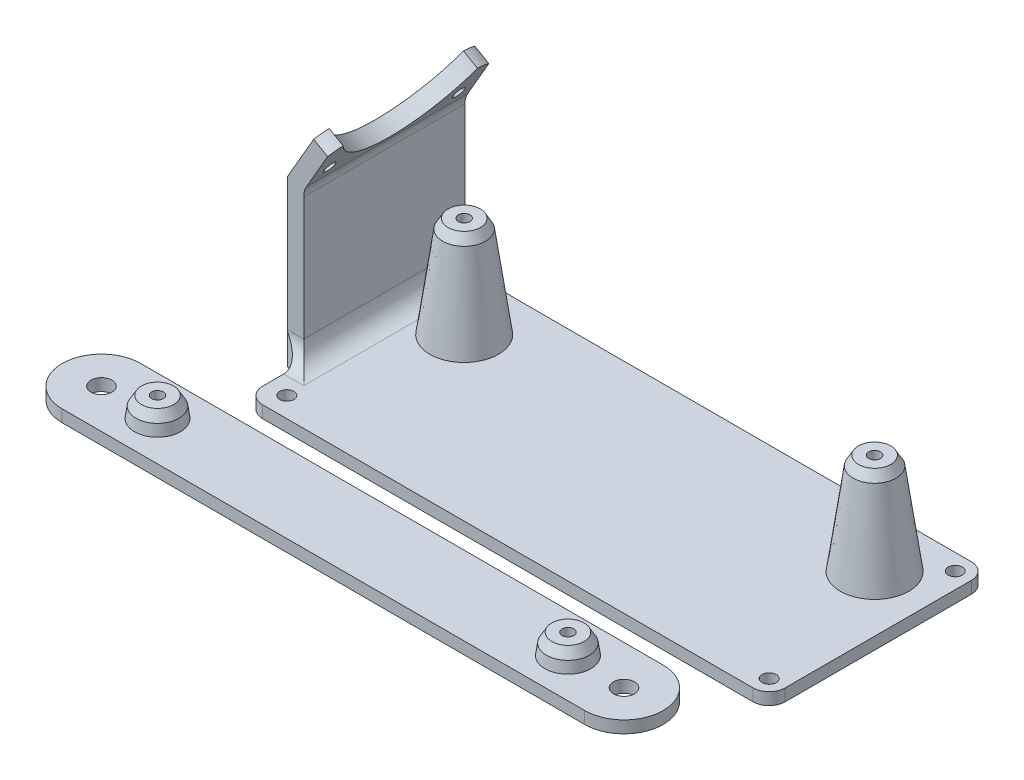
ISO-10303-21;
HEADER;
FILE_DESCRIPTION(('STEP AP214'),'2;1');
FILE_NAME('part.step','',(''),(''),'','','');
FILE_SCHEMA(('AUTOMOTIVE_DESIGN { 1 0 10303 214 1 1 1 1 }'));
ENDSEC;
DATA;
#1=APPLICATION_CONTEXT('core data for automotive mechanical design processes');
#2=APPLICATION_PROTOCOL_DEFINITION('international standard','automotive_design',2000,#1);
#3=PRODUCT_CONTEXT('',#1,'mechanical');
#4=PRODUCT('Part','Part','',(#3));
#5=PRODUCT_RELATED_PRODUCT_CATEGORY('part','',(#4));
#6=PRODUCT_DEFINITION_FORMATION('','',#4);
#7=PRODUCT_DEFINITION_CONTEXT('part definition',#1,'design');
#8=PRODUCT_DEFINITION('design','',#6,#7);
#9=PRODUCT_DEFINITION_SHAPE('','',#8);
#10=(LENGTH_UNIT() NAMED_UNIT(*) SI_UNIT(.MILLI.,.METRE.));
#11=(NAMED_UNIT(*) PLANE_ANGLE_UNIT() SI_UNIT($,.RADIAN.));
#12=(NAMED_UNIT(*) SI_UNIT($,.STERADIAN.) SOLID_ANGLE_UNIT());
#13=UNCERTAINTY_MEASURE_WITH_UNIT(LENGTH_MEASURE(1.E-05),#10,'distance_accuracy_value','');
#14=(GEOMETRIC_REPRESENTATION_CONTEXT(3) GLOBAL_UNCERTAINTY_ASSIGNED_CONTEXT((#13)) GLOBAL_UNIT_ASSIGNED_CONTEXT((#10,
#11,#12)) REPRESENTATION_CONTEXT('',''));
#15=CARTESIAN_POINT('',(0.,0.,0.));
#16=DIRECTION('',(0.,0.,1.));
#17=DIRECTION('',(1.,0.,0.));
#18=AXIS2_PLACEMENT_3D('',#15,#16,#17);
#19=CARTESIAN_POINT('',(64.835,20.,38.05));
#20=DIRECTION('',(0.,-1.,0.));
#21=DIRECTION('',(0.,0.,-1.));
#22=AXIS2_PLACEMENT_3D('',#19,#20,#21);
#23=PLANE('',#22);
#24=CARTESIAN_POINT('',(50.925,20.,38.05));
#25=DIRECTION('',(0.,-1.,0.));
#26=DIRECTION('',(0.,0.,-1.));
#27=AXIS2_PLACEMENT_3D('',#24,#25,#26);
#28=CIRCLE('',#27,1.45);
#29=CARTESIAN_POINT('',(50.925,20.,36.6));
#30=VERTEX_POINT('',#29);
#31=EDGE_CURVE('E275',#30,#30,#28,.T.);
#32=ORIENTED_EDGE('',*,*,#31,.F.);
#33=EDGE_LOOP('',(#32));
#34=FACE_BOUND('',#33,.T.);
#35=CARTESIAN_POINT('',(-50.925,20.,38.05));
#36=DIRECTION('',(0.,-1.,0.));
#37=DIRECTION('',(0.,0.,-1.));
#38=AXIS2_PLACEMENT_3D('',#35,#36,#37);
#39=CIRCLE('',#38,1.45);
#40=CARTESIAN_POINT('',(-50.925,20.,36.6));
#41=VERTEX_POINT('',#40);
#42=EDGE_CURVE('E164',#41,#41,#39,.T.);
#43=ORIENTED_EDGE('',*,*,#42,.F.);
#44=EDGE_LOOP('',(#43));
#45=FACE_BOUND('',#44,.T.);
#46=CARTESIAN_POINT('',(-64.835,20.,38.05));
#47=DIRECTION('',(0.,1.,0.));
#48=DIRECTION('',(0.,0.,1.));
#49=AXIS2_PLACEMENT_3D('',#46,#47,#48);
#50=CIRCLE('',#49,2.6);
#51=CARTESIAN_POINT('',(-64.835,20.,40.65));
#52=VERTEX_POINT('',#51);
#53=EDGE_CURVE('E161',#52,#52,#50,.T.);
#54=ORIENTED_EDGE('',*,*,#53,.T.);
#55=EDGE_LOOP('',(#54));
#56=FACE_BOUND('',#55,.T.);
#57=CARTESIAN_POINT('',(64.835,20.,38.05));
#58=DIRECTION('',(0.,1.,0.));
#59=DIRECTION('',(0.,0.,-1.));
#60=AXIS2_PLACEMENT_3D('',#57,#58,#59);
#61=CIRCLE('',#60,2.59999999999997);
#62=CARTESIAN_POINT('',(64.835,20.,35.45));
#63=VERTEX_POINT('',#62);
#64=EDGE_CURVE('E160',#63,#63,#61,.T.);
#65=ORIENTED_EDGE('',*,*,#64,.T.);
#66=EDGE_LOOP('',(#65));
#67=FACE_BOUND('',#66,.T.);
#68=DIRECTION('',(1.,0.,0.));
#69=VECTOR('',#68,1.);
#70=CARTESIAN_POINT('',(-64.835,20.,47.8));
#71=LINE('',#70,#69);
#72=CARTESIAN_POINT('',(-64.835,20.,47.8));
#73=VERTEX_POINT('',#72);
#74=CARTESIAN_POINT('',(64.835,20.,47.7999999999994));
#75=VERTEX_POINT('',#74);
#76=EDGE_CURVE('E134',#73,#75,#71,.T.);
#77=ORIENTED_EDGE('',*,*,#76,.F.);
#78=CARTESIAN_POINT('',(-64.835,20.,38.05));
#79=DIRECTION('',(0.,1.,0.));
#80=DIRECTION('',(0.,0.,-1.));
#81=AXIS2_PLACEMENT_3D('',#78,#79,#80);
#82=CIRCLE('',#81,9.75);
#83=CARTESIAN_POINT('',(-64.835,20.,28.3));
#84=VERTEX_POINT('',#83);
#85=EDGE_CURVE('E127',#84,#73,#82,.T.);
#86=ORIENTED_EDGE('',*,*,#85,.F.);
#87=DIRECTION('',(-1.,0.,0.));
#88=VECTOR('',#87,1.);
#89=CARTESIAN_POINT('',(-64.835,20.,28.3));
#90=LINE('',#89,#88);
#91=CARTESIAN_POINT('',(64.835,20.,28.3));
#92=VERTEX_POINT('',#91);
#93=EDGE_CURVE('E110',#92,#84,#90,.T.);
#94=ORIENTED_EDGE('',*,*,#93,.F.);
#95=CARTESIAN_POINT('',(64.835,20.,38.05));
#96=DIRECTION('',(0.,1.,0.));
#97=DIRECTION('',(0.,0.,-1.));
#98=AXIS2_PLACEMENT_3D('',#95,#96,#97);
#99=CIRCLE('',#98,9.74999999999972);
#100=EDGE_CURVE('E152',#75,#92,#99,.T.);
#101=ORIENTED_EDGE('',*,*,#100,.F.);
#102=EDGE_LOOP('',(#77,#86,#94,#101));
#103=FACE_BOUND('',#102,.T.);
#104=ADVANCED_FACE('F84',(#34,#45,#56,#67,#103),#23,.T.);
#105=CARTESIAN_POINT('',(64.835,23.,38.05));
#106=DIRECTION('',(0.,-1.,0.));
#107=DIRECTION('',(0.,0.,-1.));
#108=AXIS2_PLACEMENT_3D('',#105,#106,#107);
#109=PLANE('',#108);
#110=CARTESIAN_POINT('',(-50.925,23.,38.05));
#111=DIRECTION('',(0.,-1.,0.));
#112=DIRECTION('',(0.,0.,-1.));
#113=AXIS2_PLACEMENT_3D('',#110,#111,#112);
#114=CIRCLE('',#113,5.70270417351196);
#115=CARTESIAN_POINT('',(-50.925,23.,32.347295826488));
#116=VERTEX_POINT('',#115);
#117=EDGE_CURVE('E243',#116,#116,#114,.F.);
#118=ORIENTED_EDGE('',*,*,#117,.F.);
#119=EDGE_LOOP('',(#118));
#120=FACE_BOUND('',#119,.T.);
#121=CARTESIAN_POINT('',(50.925,23.,38.05));
#122=DIRECTION('',(0.,-1.,0.));
#123=DIRECTION('',(0.,0.,-1.));
#124=AXIS2_PLACEMENT_3D('',#121,#122,#123);
#125=CIRCLE('',#124,5.70270417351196);
#126=CARTESIAN_POINT('',(50.925,23.,32.347295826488));
#127=VERTEX_POINT('',#126);
#128=EDGE_CURVE('E13',#127,#127,#125,.F.);
#129=ORIENTED_EDGE('',*,*,#128,.F.);
#130=EDGE_LOOP('',(#129));
#131=FACE_BOUND('',#130,.T.);
#132=CARTESIAN_POINT('',(64.835,23.,38.05));
#133=DIRECTION('',(0.,1.,0.));
#134=DIRECTION('',(0.,0.,-1.));
#135=AXIS2_PLACEMENT_3D('',#132,#133,#134);
#136=CIRCLE('',#135,9.74999999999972);
#137=CARTESIAN_POINT('',(64.835,23.,47.7999999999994));
#138=VERTEX_POINT('',#137);
#139=CARTESIAN_POINT('',(64.835,23.,28.3));
#140=VERTEX_POINT('',#139);
#141=EDGE_CURVE('E158',#138,#140,#136,.T.);
#142=ORIENTED_EDGE('',*,*,#141,.T.);
#143=DIRECTION('',(-1.,0.,0.));
#144=VECTOR('',#143,1.);
#145=CARTESIAN_POINT('',(-64.835,23.,28.3));
#146=LINE('',#145,#144);
#147=CARTESIAN_POINT('',(-64.835,23.,28.3));
#148=VERTEX_POINT('',#147);
#149=EDGE_CURVE('E101',#140,#148,#146,.T.);
#150=ORIENTED_EDGE('',*,*,#149,.T.);
#151=CARTESIAN_POINT('',(-64.835,23.,38.05));
#152=DIRECTION('',(0.,1.,0.));
#153=DIRECTION('',(0.,0.,-1.));
#154=AXIS2_PLACEMENT_3D('',#151,#152,#153);
#155=CIRCLE('',#154,9.75);
#156=CARTESIAN_POINT('',(-64.835,23.,47.8));
#157=VERTEX_POINT('',#156);
#158=EDGE_CURVE('E145',#148,#157,#155,.T.);
#159=ORIENTED_EDGE('',*,*,#158,.T.);
#160=DIRECTION('',(1.,0.,0.));
#161=VECTOR('',#160,1.);
#162=CARTESIAN_POINT('',(-64.835,23.,47.8));
#163=LINE('',#162,#161);
#164=EDGE_CURVE('E154',#157,#138,#163,.T.);
#165=ORIENTED_EDGE('',*,*,#164,.T.);
#166=EDGE_LOOP('',(#142,#150,#159,#165));
#167=FACE_BOUND('',#166,.T.);
#168=CARTESIAN_POINT('',(-64.835,23.,38.05));
#169=DIRECTION('',(0.,1.,0.));
#170=DIRECTION('',(0.,0.,1.));
#171=AXIS2_PLACEMENT_3D('',#168,#169,#170);
#172=CIRCLE('',#171,2.6);
#173=CARTESIAN_POINT('',(-64.835,23.,40.65));
#174=VERTEX_POINT('',#173);
#175=EDGE_CURVE('E165',#174,#174,#172,.T.);
#176=ORIENTED_EDGE('',*,*,#175,.F.);
#177=EDGE_LOOP('',(#176));
#178=FACE_BOUND('',#177,.T.);
#179=CARTESIAN_POINT('',(64.835,23.,38.05));
#180=DIRECTION('',(0.,1.,0.));
#181=DIRECTION('',(0.,0.,-1.));
#182=AXIS2_PLACEMENT_3D('',#179,#180,#181);
#183=CIRCLE('',#182,2.59999999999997);
#184=CARTESIAN_POINT('',(64.835,23.,35.45));
#185=VERTEX_POINT('',#184);
#186=EDGE_CURVE('E88',#185,#185,#183,.T.);
#187=ORIENTED_EDGE('',*,*,#186,.F.);
#188=EDGE_LOOP('',(#187));
#189=FACE_BOUND('',#188,.T.);
#190=ADVANCED_FACE('F187',(#120,#131,#167,#178,#189),#109,.F.);
#191=CARTESIAN_POINT('',(64.835,23.,38.05));
#192=DIRECTION('',(0.,-1.,0.));
#193=DIRECTION('',(0.,0.,-1.));
#194=AXIS2_PLACEMENT_3D('',#191,#192,#193);
#195=CYLINDRICAL_SURFACE('',#194,9.74999999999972);
#196=ORIENTED_EDGE('',*,*,#100,.T.);
#197=DIRECTION('',(0.,-1.,0.));
#198=VECTOR('',#197,1.);
#199=CARTESIAN_POINT('',(64.835,23.,28.3));
#200=LINE('',#199,#198);
#201=EDGE_CURVE('E140',#140,#92,#200,.T.);
#202=ORIENTED_EDGE('',*,*,#201,.F.);
#203=ORIENTED_EDGE('',*,*,#141,.F.);
#204=DIRECTION('',(0.,-1.,0.));
#205=VECTOR('',#204,1.);
#206=CARTESIAN_POINT('',(64.835,23.,47.7999999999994));
#207=LINE('',#206,#205);
#208=EDGE_CURVE('E142',#138,#75,#207,.T.);
#209=ORIENTED_EDGE('',*,*,#208,.T.);
#210=EDGE_LOOP('',(#196,#202,#203,#209));
#211=FACE_BOUND('',#210,.T.);
#212=ADVANCED_FACE('F193',(#211),#195,.T.);
#213=CARTESIAN_POINT('',(-64.835,23.,28.3));
#214=DIRECTION('',(0.,0.,1.));
#215=DIRECTION('',(1.,0.,0.));
#216=AXIS2_PLACEMENT_3D('',#213,#214,#215);
#217=PLANE('',#216);
#218=ORIENTED_EDGE('',*,*,#93,.T.);
#219=DIRECTION('',(0.,-1.,0.));
#220=VECTOR('',#219,1.);
#221=CARTESIAN_POINT('',(-64.835,23.,28.3));
#222=LINE('',#221,#220);
#223=EDGE_CURVE('E137',#148,#84,#222,.T.);
#224=ORIENTED_EDGE('',*,*,#223,.F.);
#225=ORIENTED_EDGE('',*,*,#149,.F.);
#226=ORIENTED_EDGE('',*,*,#201,.T.);
#227=EDGE_LOOP('',(#218,#224,#225,#226));
#228=FACE_BOUND('',#227,.T.);
#229=ADVANCED_FACE('F136',(#228),#217,.F.);
#230=CARTESIAN_POINT('',(-64.835,23.,38.05));
#231=DIRECTION('',(0.,-1.,0.));
#232=DIRECTION('',(0.,0.,-1.));
#233=AXIS2_PLACEMENT_3D('',#230,#231,#232);
#234=CYLINDRICAL_SURFACE('',#233,9.75);
#235=ORIENTED_EDGE('',*,*,#85,.T.);
#236=DIRECTION('',(0.,-1.,0.));
#237=VECTOR('',#236,1.);
#238=CARTESIAN_POINT('',(-64.835,23.,47.8));
#239=LINE('',#238,#237);
#240=EDGE_CURVE('E167',#157,#73,#239,.T.);
#241=ORIENTED_EDGE('',*,*,#240,.F.);
#242=ORIENTED_EDGE('',*,*,#158,.F.);
#243=ORIENTED_EDGE('',*,*,#223,.T.);
#244=EDGE_LOOP('',(#235,#241,#242,#243));
#245=FACE_BOUND('',#244,.T.);
#246=ADVANCED_FACE('F144',(#245),#234,.T.);
#247=CARTESIAN_POINT('',(-64.835,23.,47.8));
#248=DIRECTION('',(0.,0.,-1.));
#249=DIRECTION('',(-1.,0.,0.));
#250=AXIS2_PLACEMENT_3D('',#247,#248,#249);
#251=PLANE('',#250);
#252=ORIENTED_EDGE('',*,*,#76,.T.);
#253=ORIENTED_EDGE('',*,*,#208,.F.);
#254=ORIENTED_EDGE('',*,*,#164,.F.);
#255=ORIENTED_EDGE('',*,*,#240,.T.);
#256=EDGE_LOOP('',(#252,#253,#254,#255));
#257=FACE_BOUND('',#256,.T.);
#258=ADVANCED_FACE('F183',(#257),#251,.F.);
#259=CARTESIAN_POINT('',(-64.835,23.,38.05));
#260=DIRECTION('',(0.,-1.,0.));
#261=DIRECTION('',(0.,0.,-1.));
#262=AXIS2_PLACEMENT_3D('',#259,#260,#261);
#263=CYLINDRICAL_SURFACE('',#262,2.6);
#264=ORIENTED_EDGE('',*,*,#175,.T.);
#265=EDGE_LOOP('',(#264));
#266=FACE_BOUND('',#265,.T.);
#267=ORIENTED_EDGE('',*,*,#53,.F.);
#268=EDGE_LOOP('',(#267));
#269=FACE_BOUND('',#268,.T.);
#270=ADVANCED_FACE('F174',(#266,#269),#263,.F.);
#271=CARTESIAN_POINT('',(64.835,23.,38.05));
#272=DIRECTION('',(0.,-1.,0.));
#273=DIRECTION('',(0.,0.,-1.));
#274=AXIS2_PLACEMENT_3D('',#271,#272,#273);
#275=CYLINDRICAL_SURFACE('',#274,2.59999999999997);
#276=ORIENTED_EDGE('',*,*,#186,.T.);
#277=EDGE_LOOP('',(#276));
#278=FACE_BOUND('',#277,.T.);
#279=ORIENTED_EDGE('',*,*,#64,.F.);
#280=EDGE_LOOP('',(#279));
#281=FACE_BOUND('',#280,.T.);
#282=ADVANCED_FACE('F86',(#278,#281),#275,.F.);
#283=CARTESIAN_POINT('',(-50.925,28.,38.05));
#284=DIRECTION('',(0.,1.,0.));
#285=DIRECTION('',(0.,0.,1.));
#286=AXIS2_PLACEMENT_3D('',#283,#284,#285);
#287=PLANE('',#286);
#288=CARTESIAN_POINT('',(-50.925,28.,38.05));
#289=DIRECTION('',(0.,1.,0.));
#290=DIRECTION('',(0.,0.,1.));
#291=AXIS2_PLACEMENT_3D('',#288,#289,#290);
#292=CIRCLE('',#291,4.);
#293=CARTESIAN_POINT('',(-50.925,28.,42.05));
#294=VERTEX_POINT('',#293);
#295=EDGE_CURVE('E256',#294,#294,#292,.T.);
#296=ORIENTED_EDGE('',*,*,#295,.T.);
#297=EDGE_LOOP('',(#296));
#298=FACE_BOUND('',#297,.T.);
#299=CARTESIAN_POINT('',(-50.925,28.,38.05));
#300=DIRECTION('',(0.,1.,0.));
#301=DIRECTION('',(0.,0.,1.));
#302=AXIS2_PLACEMENT_3D('',#299,#300,#301);
#303=CIRCLE('',#302,1.45);
#304=CARTESIAN_POINT('',(-50.925,28.,39.5));
#305=VERTEX_POINT('',#304);
#306=EDGE_CURVE('E255',#305,#305,#303,.T.);
#307=ORIENTED_EDGE('',*,*,#306,.F.);
#308=EDGE_LOOP('',(#307));
#309=FACE_BOUND('',#308,.T.);
#310=ADVANCED_FACE('F173',(#298,#309),#287,.T.);
#311=CARTESIAN_POINT('',(-50.925,0.,38.05));
#312=DIRECTION('',(0.,1.,0.));
#313=DIRECTION('',(0.,0.,1.));
#314=AXIS2_PLACEMENT_3D('',#311,#312,#313);
#315=CYLINDRICAL_SURFACE('',#314,1.45);
#316=ORIENTED_EDGE('',*,*,#306,.T.);
#317=EDGE_LOOP('',(#316));
#318=FACE_BOUND('',#317,.T.);
#319=ORIENTED_EDGE('',*,*,#42,.T.);
#320=EDGE_LOOP('',(#319));
#321=FACE_BOUND('',#320,.T.);
#322=ADVANCED_FACE('F180',(#318,#321),#315,.F.);
#323=CARTESIAN_POINT('',(-50.925,28.,38.05));
#324=DIRECTION('',(0.,-1.,0.));
#325=DIRECTION('',(0.,0.,-1.));
#326=AXIS2_PLACEMENT_3D('',#323,#324,#325);
#327=CONICAL_SURFACE('',#326,4.,0.523598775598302);
#328=CARTESIAN_POINT('',(-50.925,25.7106721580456,38.05));
#329=DIRECTION('',(0.,1.,0.));
#330=DIRECTION('',(0.,0.,1.));
#331=AXIS2_PLACEMENT_3D('',#328,#329,#330);
#332=CIRCLE('',#331,5.32174404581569);
#333=CARTESIAN_POINT('',(-50.925,25.7106721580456,43.3717440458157));
#334=VERTEX_POINT('',#333);
#335=EDGE_CURVE('E248',#334,#334,#332,.F.);
#336=ORIENTED_EDGE('',*,*,#335,.F.);
#337=EDGE_LOOP('',(#336));
#338=FACE_BOUND('',#337,.T.);
#339=ORIENTED_EDGE('',*,*,#295,.F.);
#340=EDGE_LOOP('',(#339));
#341=FACE_BOUND('',#340,.T.);
#342=ADVANCED_FACE('F216',(#338,#341),#327,.T.);
#343=CARTESIAN_POINT('',(-50.925,28.,38.05));
#344=DIRECTION('',(0.,-1.,0.));
#345=DIRECTION('',(0.,0.,1.));
#346=AXIS2_PLACEMENT_3D('',#343,#344,#345);
#347=CONICAL_SURFACE('',#346,5.,0.139626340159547);
#348=ORIENTED_EDGE('',*,*,#335,.T.);
#349=EDGE_LOOP('',(#348));
#350=FACE_BOUND('',#349,.T.);
#351=ORIENTED_EDGE('',*,*,#117,.T.);
#352=EDGE_LOOP('',(#351));
#353=FACE_BOUND('',#352,.T.);
#354=ADVANCED_FACE('F220',(#350,#353),#347,.T.);
#355=CARTESIAN_POINT('',(50.925,28.,38.05));
#356=DIRECTION('',(0.,1.,0.));
#357=DIRECTION('',(0.,0.,1.));
#358=AXIS2_PLACEMENT_3D('',#355,#356,#357);
#359=PLANE('',#358);
#360=CARTESIAN_POINT('',(50.925,28.,38.05));
#361=DIRECTION('',(0.,1.,0.));
#362=DIRECTION('',(0.,0.,1.));
#363=AXIS2_PLACEMENT_3D('',#360,#361,#362);
#364=CIRCLE('',#363,4.);
#365=CARTESIAN_POINT('',(50.925,28.,42.05));
#366=VERTEX_POINT('',#365);
#367=EDGE_CURVE('E241',#366,#366,#364,.T.);
#368=ORIENTED_EDGE('',*,*,#367,.T.);
#369=EDGE_LOOP('',(#368));
#370=FACE_BOUND('',#369,.T.);
#371=CARTESIAN_POINT('',(50.925,28.,38.05));
#372=DIRECTION('',(0.,1.,0.));
#373=DIRECTION('',(0.,0.,1.));
#374=AXIS2_PLACEMENT_3D('',#371,#372,#373);
#375=CIRCLE('',#374,1.45);
#376=CARTESIAN_POINT('',(50.925,28.,39.5));
#377=VERTEX_POINT('',#376);
#378=EDGE_CURVE('E242',#377,#377,#375,.T.);
#379=ORIENTED_EDGE('',*,*,#378,.F.);
#380=EDGE_LOOP('',(#379));
#381=FACE_BOUND('',#380,.T.);
#382=ADVANCED_FACE('F212',(#370,#381),#359,.T.);
#383=CARTESIAN_POINT('',(50.925,0.,38.05));
#384=DIRECTION('',(0.,1.,0.));
#385=DIRECTION('',(0.,0.,1.));
#386=AXIS2_PLACEMENT_3D('',#383,#384,#385);
#387=CYLINDRICAL_SURFACE('',#386,1.45);
#388=ORIENTED_EDGE('',*,*,#378,.T.);
#389=EDGE_LOOP('',(#388));
#390=FACE_BOUND('',#389,.T.);
#391=ORIENTED_EDGE('',*,*,#31,.T.);
#392=EDGE_LOOP('',(#391));
#393=FACE_BOUND('',#392,.T.);
#394=ADVANCED_FACE('F208',(#390,#393),#387,.F.);
#395=CARTESIAN_POINT('',(50.925,28.,38.05));
#396=DIRECTION('',(0.,-1.,0.));
#397=DIRECTION('',(0.,0.,-1.));
#398=AXIS2_PLACEMENT_3D('',#395,#396,#397);
#399=CONICAL_SURFACE('',#398,4.,0.523598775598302);
#400=CARTESIAN_POINT('',(50.925,25.7106721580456,38.05));
#401=DIRECTION('',(0.,1.,0.));
#402=DIRECTION('',(0.,0.,1.));
#403=AXIS2_PLACEMENT_3D('',#400,#401,#402);
#404=CIRCLE('',#403,5.32174404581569);
#405=CARTESIAN_POINT('',(50.925,25.7106721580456,43.3717440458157));
#406=VERTEX_POINT('',#405);
#407=EDGE_CURVE('E93',#406,#406,#404,.F.);
#408=ORIENTED_EDGE('',*,*,#407,.F.);
#409=EDGE_LOOP('',(#408));
#410=FACE_BOUND('',#409,.T.);
#411=ORIENTED_EDGE('',*,*,#367,.F.);
#412=EDGE_LOOP('',(#411));
#413=FACE_BOUND('',#412,.T.);
#414=ADVANCED_FACE('F211',(#410,#413),#399,.T.);
#415=CARTESIAN_POINT('',(50.925,28.,38.05));
#416=DIRECTION('',(0.,-1.,0.));
#417=DIRECTION('',(0.,0.,1.));
#418=AXIS2_PLACEMENT_3D('',#415,#416,#417);
#419=CONICAL_SURFACE('',#418,5.,0.139626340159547);
#420=ORIENTED_EDGE('',*,*,#407,.T.);
#421=EDGE_LOOP('',(#420));
#422=FACE_BOUND('',#421,.T.);
#423=ORIENTED_EDGE('',*,*,#128,.T.);
#424=EDGE_LOOP('',(#423));
#425=FACE_BOUND('',#424,.T.);
#426=ADVANCED_FACE('F222',(#422,#425),#419,.T.);
#427=CLOSED_SHELL('',(#104,#190,#212,#229,#246,#258,#270,#282,#310,#322,#342,#354,#382,#394,
#414,#426));
#428=MANIFOLD_SOLID_BREP('B2',#427);
#429=CARTESIAN_POINT('',(-64.835,3.,-47.15));
#430=DIRECTION('',(1.,0.,0.));
#431=DIRECTION('',(0.,0.,-1.));
#432=AXIS2_PLACEMENT_3D('',#429,#430,#431);
#433=PLANE('',#432);
#434=DIRECTION('',(0.,1.,0.));
#435=VECTOR('',#434,1.);
#436=CARTESIAN_POINT('',(-64.8350000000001,-132.873281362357,-1.95000000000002));
#437=LINE('',#436,#435);
#438=CARTESIAN_POINT('',(-64.8350000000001,0.,-1.95000000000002));
#439=VERTEX_POINT('',#438);
#440=CARTESIAN_POINT('',(-64.835,3.,-1.95000000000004));
#441=VERTEX_POINT('',#440);
#442=EDGE_CURVE('E809',#439,#441,#437,.T.);
#443=ORIENTED_EDGE('',*,*,#442,.T.);
#444=DIRECTION('',(0.,0.,1.));
#445=VECTOR('',#444,1.);
#446=CARTESIAN_POINT('',(-64.835,3.,-47.15));
#447=LINE('',#446,#445);
#448=CARTESIAN_POINT('',(-64.835,3.,-7.15));
#449=VERTEX_POINT('',#448);
#450=EDGE_CURVE('E573',#449,#441,#447,.T.);
#451=ORIENTED_EDGE('',*,*,#450,.F.);
#452=CARTESIAN_POINT('',(-64.835,8.,-7.14999999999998));
#453=DIRECTION('',(1.,0.,0.));
#454=DIRECTION('',(0.,0.,-1.));
#455=AXIS2_PLACEMENT_3D('',#452,#453,#454);
#456=CIRCLE('',#455,5.);
#457=CARTESIAN_POINT('',(-64.835,3.00102061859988,-7.25102051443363));
#458=VERTEX_POINT('',#457);
#459=EDGE_CURVE('E628',#449,#458,#456,.T.);
#460=ORIENTED_EDGE('',*,*,#459,.T.);
#461=CARTESIAN_POINT('',(-64.835,3.00102061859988,-7.25102051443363));
#462=CARTESIAN_POINT('',(-64.835,3.,-7.25102051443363));
#463=B_SPLINE_CURVE_WITH_KNOTS('',1,(#461,#462),.UNSPECIFIED.,.F.,.F.,(2,2),(0.,1.),.UNSPECIFIED.);
#464=CARTESIAN_POINT('',(-64.835,3.,-7.25102051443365));
#465=VERTEX_POINT('',#464);
#466=EDGE_CURVE('E633',#458,#465,#463,.T.);
#467=ORIENTED_EDGE('',*,*,#466,.T.);
#468=DIRECTION('',(0.,-1.,0.));
#469=VECTOR('',#468,1.);
#470=CARTESIAN_POINT('',(-64.835,3.00000000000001,-7.25102051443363));
#471=LINE('',#470,#469);
#472=CARTESIAN_POINT('',(-64.835,0.,-7.25102051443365));
#473=VERTEX_POINT('',#472);
#474=EDGE_CURVE('E626',#465,#473,#471,.T.);
#475=ORIENTED_EDGE('',*,*,#474,.T.);
#476=DIRECTION('',(0.,0.,1.));
#477=VECTOR('',#476,1.);
#478=CARTESIAN_POINT('',(-64.835,0.,-47.15));
#479=LINE('',#478,#477);
#480=EDGE_CURVE('E560',#473,#439,#479,.T.);
#481=ORIENTED_EDGE('',*,*,#480,.T.);
#482=EDGE_LOOP('',(#443,#451,#460,#467,#475,#481));
#483=FACE_BOUND('',#482,.T.);
#484=ADVANCED_FACE('F391',(#483),#433,.F.);
#485=CARTESIAN_POINT('',(-18.3266547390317,37.2424051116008,-32.15));
#486=DIRECTION('',(-0.866025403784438,0.500000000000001,0.));
#487=DIRECTION('',(-0.500000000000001,-0.866025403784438,0.));
#488=AXIS2_PLACEMENT_3D('',#485,#486,#487);
#489=CYLINDRICAL_SURFACE('',#488,18.5);
#490=DIRECTION('',(-0.866025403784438,0.500000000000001,0.));
#491=VECTOR('',#490,1.);
#492=CARTESIAN_POINT('',(-22.3405994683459,30.2900489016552,-48.8174230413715));
#493=LINE('',#492,#491);
#494=CARTESIAN_POINT('',(-58.3848431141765,51.100202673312,-48.8174230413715));
#495=VERTEX_POINT('',#494);
#496=CARTESIAN_POINT('',(-61.8489447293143,53.1002026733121,-48.8174230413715));
#497=VERTEX_POINT('',#496);
#498=EDGE_CURVE('E844',#495,#497,#493,.T.);
#499=ORIENTED_EDGE('',*,*,#498,.T.);
#500=CARTESIAN_POINT('',(-57.835,60.0525588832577,-32.15));
#501=DIRECTION('',(-0.866025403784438,0.500000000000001,0.));
#502=DIRECTION('',(-0.500000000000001,-0.866025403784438,0.));
#503=AXIS2_PLACEMENT_3D('',#500,#501,#502);
#504=CIRCLE('',#503,18.5);
#505=CARTESIAN_POINT('',(-61.8489447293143,53.1002026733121,-15.4825769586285));
#506=VERTEX_POINT('',#505);
#507=EDGE_CURVE('E837',#497,#506,#504,.T.);
#508=ORIENTED_EDGE('',*,*,#507,.T.);
#509=DIRECTION('',(-0.866025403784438,0.500000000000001,0.));
#510=VECTOR('',#509,1.);
#511=CARTESIAN_POINT('',(-22.3405994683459,30.2900489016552,-15.4825769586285));
#512=LINE('',#511,#510);
#513=CARTESIAN_POINT('',(-58.3848431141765,51.1002026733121,-15.4825769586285));
#514=VERTEX_POINT('',#513);
#515=EDGE_CURVE('E847',#514,#506,#512,.T.);
#516=ORIENTED_EDGE('',*,*,#515,.F.);
#517=CARTESIAN_POINT('',(-54.3708983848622,58.0525588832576,-32.15));
#518=DIRECTION('',(0.866025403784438,-0.500000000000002,0.));
#519=DIRECTION('',(0.500000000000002,0.866025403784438,0.));
#520=AXIS2_PLACEMENT_3D('',#517,#518,#519);
#521=CIRCLE('',#520,18.5);
#522=EDGE_CURVE('E836',#495,#514,#521,.F.);
#523=ORIENTED_EDGE('',*,*,#522,.F.);
#524=EDGE_LOOP('',(#499,#508,#516,#523));
#525=FACE_BOUND('',#524,.T.);
#526=ADVANCED_FACE('F648',(#525),#489,.F.);
#527=CARTESIAN_POINT('',(-26.3266547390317,23.3859986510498,-16.15));
#528=DIRECTION('',(-0.866025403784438,0.500000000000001,0.));
#529=DIRECTION('',(-0.500000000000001,-0.866025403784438,0.));
#530=AXIS2_PLACEMENT_3D('',#527,#528,#529);
#531=CYLINDRICAL_SURFACE('',#530,1.4);
#532=CARTESIAN_POINT('',(-65.835,46.1961524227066,-16.15));
#533=DIRECTION('',(-0.866025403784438,0.500000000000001,0.));
#534=DIRECTION('',(-0.500000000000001,-0.866025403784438,0.));
#535=AXIS2_PLACEMENT_3D('',#532,#533,#534);
#536=CIRCLE('',#535,1.4);
#537=CARTESIAN_POINT('',(-66.535,44.9837168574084,-16.15));
#538=VERTEX_POINT('',#537);
#539=EDGE_CURVE('E821',#538,#538,#536,.T.);
#540=ORIENTED_EDGE('',*,*,#539,.T.);
#541=EDGE_LOOP('',(#540));
#542=FACE_BOUND('',#541,.T.);
#543=CARTESIAN_POINT('',(-62.3708983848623,44.1961524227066,-16.15));
#544=DIRECTION('',(0.866025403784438,-0.500000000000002,0.));
#545=DIRECTION('',(0.500000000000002,0.866025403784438,0.));
#546=AXIS2_PLACEMENT_3D('',#543,#544,#545);
#547=CIRCLE('',#546,1.4);
#548=CARTESIAN_POINT('',(-61.6708983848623,45.4085879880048,-16.15));
#549=VERTEX_POINT('',#548);
#550=EDGE_CURVE('E824',#549,#549,#547,.F.);
#551=ORIENTED_EDGE('',*,*,#550,.F.);
#552=EDGE_LOOP('',(#551));
#553=FACE_BOUND('',#552,.T.);
#554=ADVANCED_FACE('F922',(#542,#553),#531,.F.);
#555=CARTESIAN_POINT('',(-26.3266547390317,23.3859986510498,-48.15));
#556=DIRECTION('',(-0.866025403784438,0.500000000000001,0.));
#557=DIRECTION('',(-0.500000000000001,-0.866025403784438,0.));
#558=AXIS2_PLACEMENT_3D('',#555,#556,#557);
#559=CYLINDRICAL_SURFACE('',#558,1.4);
#560=CARTESIAN_POINT('',(-65.835,46.1961524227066,-48.15));
#561=DIRECTION('',(-0.866025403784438,0.500000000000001,0.));
#562=DIRECTION('',(-0.500000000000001,-0.866025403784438,0.));
#563=AXIS2_PLACEMENT_3D('',#560,#561,#562);
#564=CIRCLE('',#563,1.4);
#565=CARTESIAN_POINT('',(-66.535,44.9837168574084,-48.15));
#566=VERTEX_POINT('',#565);
#567=EDGE_CURVE('E829',#566,#566,#564,.T.);
#568=ORIENTED_EDGE('',*,*,#567,.T.);
#569=EDGE_LOOP('',(#568));
#570=FACE_BOUND('',#569,.T.);
#571=CARTESIAN_POINT('',(-62.3708983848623,44.1961524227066,-48.15));
#572=DIRECTION('',(0.866025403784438,-0.500000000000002,0.));
#573=DIRECTION('',(0.500000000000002,0.866025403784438,0.));
#574=AXIS2_PLACEMENT_3D('',#571,#572,#573);
#575=CIRCLE('',#574,1.4);
#576=CARTESIAN_POINT('',(-61.6708983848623,45.4085879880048,-48.15));
#577=VERTEX_POINT('',#576);
#578=EDGE_CURVE('E825',#577,#577,#575,.F.);
#579=ORIENTED_EDGE('',*,*,#578,.F.);
#580=EDGE_LOOP('',(#579));
#581=FACE_BOUND('',#580,.T.);
#582=ADVANCED_FACE('F917',(#570,#581),#559,.F.);
#583=CARTESIAN_POINT('',(-26.3266547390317,23.3859986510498,-16.15));
#584=DIRECTION('',(-0.866025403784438,0.500000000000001,0.));
#585=DIRECTION('',(-0.500000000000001,-0.866025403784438,0.));
#586=AXIS2_PLACEMENT_3D('',#583,#584,#585);
#587=CYLINDRICAL_SURFACE('',#586,8.);
#588=ORIENTED_EDGE('',*,*,#515,.T.);
#589=CARTESIAN_POINT('',(-65.835,46.1961524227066,-16.15));
#590=DIRECTION('',(-0.866025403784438,0.500000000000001,0.));
#591=DIRECTION('',(-0.500000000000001,-0.866025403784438,0.));
#592=AXIS2_PLACEMENT_3D('',#589,#590,#591);
#593=CIRCLE('',#592,8.);
#594=CARTESIAN_POINT('',(-62.3708983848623,52.1961524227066,-12.15));
#595=VERTEX_POINT('',#594);
#596=EDGE_CURVE('E834',#506,#595,#593,.F.);
#597=ORIENTED_EDGE('',*,*,#596,.T.);
#598=DIRECTION('',(-0.866025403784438,0.500000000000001,0.));
#599=VECTOR('',#598,1.);
#600=CARTESIAN_POINT('',(-22.8625531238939,29.3859986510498,-12.15));
#601=LINE('',#600,#599);
#602=CARTESIAN_POINT('',(-58.9067967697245,50.1961524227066,-12.15));
#603=VERTEX_POINT('',#602);
#604=EDGE_CURVE('E852',#603,#595,#601,.T.);
#605=ORIENTED_EDGE('',*,*,#604,.F.);
#606=CARTESIAN_POINT('',(-62.3708983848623,44.1961524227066,-16.15));
#607=DIRECTION('',(0.866025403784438,-0.500000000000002,0.));
#608=DIRECTION('',(0.500000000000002,0.866025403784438,0.));
#609=AXIS2_PLACEMENT_3D('',#606,#607,#608);
#610=CIRCLE('',#609,8.);
#611=EDGE_CURVE('E849',#514,#603,#610,.T.);
#612=ORIENTED_EDGE('',*,*,#611,.F.);
#613=EDGE_LOOP('',(#588,#597,#605,#612));
#614=FACE_BOUND('',#613,.T.);
#615=ADVANCED_FACE('F673',(#614),#587,.T.);
#616=CARTESIAN_POINT('',(-50.925,28.,-38.05));
#617=DIRECTION('',(0.,-1.,0.));
#618=DIRECTION('',(0.,0.,-1.));
#619=AXIS2_PLACEMENT_3D('',#616,#617,#618);
#620=CONICAL_SURFACE('',#619,4.,0.523598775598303);
#621=CARTESIAN_POINT('',(-50.925,25.7106721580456,-38.05));
#622=DIRECTION('',(0.,1.,0.));
#623=DIRECTION('',(0.,0.,1.));
#624=AXIS2_PLACEMENT_3D('',#621,#622,#623);
#625=CIRCLE('',#624,5.3217440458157);
#626=CARTESIAN_POINT('',(-50.925,25.7106721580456,-32.7282559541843));
#627=VERTEX_POINT('',#626);
#628=EDGE_CURVE('E601',#627,#627,#625,.F.);
#629=ORIENTED_EDGE('',*,*,#628,.F.);
#630=EDGE_LOOP('',(#629));
#631=FACE_BOUND('',#630,.T.);
#632=CARTESIAN_POINT('',(-50.925,28.,-38.05));
#633=DIRECTION('',(0.,1.,0.));
#634=DIRECTION('',(0.,0.,1.));
#635=AXIS2_PLACEMENT_3D('',#632,#633,#634);
#636=CIRCLE('',#635,4.);
#637=CARTESIAN_POINT('',(-50.925,28.,-34.05));
#638=VERTEX_POINT('',#637);
#639=EDGE_CURVE('E598',#638,#638,#636,.T.);
#640=ORIENTED_EDGE('',*,*,#639,.F.);
#641=EDGE_LOOP('',(#640));
#642=FACE_BOUND('',#641,.T.);
#643=ADVANCED_FACE('F669',(#631,#642),#620,.T.);
#644=CARTESIAN_POINT('',(50.925,28.,-38.05));
#645=DIRECTION('',(0.,-1.,0.));
#646=DIRECTION('',(0.,0.,-1.));
#647=AXIS2_PLACEMENT_3D('',#644,#645,#646);
#648=CONICAL_SURFACE('',#647,4.,0.523598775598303);
#649=CARTESIAN_POINT('',(50.925,25.7106721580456,-38.05));
#650=DIRECTION('',(0.,1.,0.));
#651=DIRECTION('',(0.,0.,1.));
#652=AXIS2_PLACEMENT_3D('',#649,#650,#651);
#653=CIRCLE('',#652,5.3217440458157);
#654=CARTESIAN_POINT('',(50.925,25.7106721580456,-32.7282559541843));
#655=VERTEX_POINT('',#654);
#656=EDGE_CURVE('E595',#655,#655,#653,.F.);
#657=ORIENTED_EDGE('',*,*,#656,.F.);
#658=EDGE_LOOP('',(#657));
#659=FACE_BOUND('',#658,.T.);
#660=CARTESIAN_POINT('',(50.925,28.,-38.05));
#661=DIRECTION('',(0.,1.,0.));
#662=DIRECTION('',(0.,0.,1.));
#663=AXIS2_PLACEMENT_3D('',#660,#661,#662);
#664=CIRCLE('',#663,4.);
#665=CARTESIAN_POINT('',(50.925,28.,-34.05));
#666=VERTEX_POINT('',#665);
#667=EDGE_CURVE('E592',#666,#666,#664,.T.);
#668=ORIENTED_EDGE('',*,*,#667,.F.);
#669=EDGE_LOOP('',(#668));
#670=FACE_BOUND('',#669,.T.);
#671=ADVANCED_FACE('F665',(#659,#670),#648,.T.);
#672=CARTESIAN_POINT('',(-64.835,0.,0.));
#673=DIRECTION('',(1.,0.,0.));
#674=DIRECTION('',(0.,0.,-1.));
#675=AXIS2_PLACEMENT_3D('',#672,#673,#674);
#676=PLANE('',#675);
#677=DIRECTION('',(0.,1.,0.));
#678=VECTOR('',#677,1.);
#679=CARTESIAN_POINT('',(-64.835,41.,-12.15));
#680=LINE('',#679,#678);
#681=CARTESIAN_POINT('',(-64.835,8.,-12.15));
#682=VERTEX_POINT('',#681);
#683=CARTESIAN_POINT('',(-64.835,38.5884572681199,-12.15));
#684=VERTEX_POINT('',#683);
#685=EDGE_CURVE('E742',#682,#684,#680,.T.);
#686=ORIENTED_EDGE('',*,*,#685,.F.);
#687=DIRECTION('',(0.,0.,1.));
#688=VECTOR('',#687,1.);
#689=CARTESIAN_POINT('',(-64.835,8.,-52.15));
#690=LINE('',#689,#688);
#691=CARTESIAN_POINT('',(-64.835,8.,-52.15));
#692=VERTEX_POINT('',#691);
#693=EDGE_CURVE('E616',#682,#692,#690,.F.);
#694=ORIENTED_EDGE('',*,*,#693,.T.);
#695=DIRECTION('',(0.,-1.,0.));
#696=VECTOR('',#695,1.);
#697=CARTESIAN_POINT('',(-64.835,0.,-52.15));
#698=LINE('',#697,#696);
#699=CARTESIAN_POINT('',(-64.835,38.5884572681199,-52.15));
#700=VERTEX_POINT('',#699);
#701=EDGE_CURVE('E740',#700,#692,#698,.T.);
#702=ORIENTED_EDGE('',*,*,#701,.F.);
#703=DIRECTION('',(0.,0.,-1.));
#704=VECTOR('',#703,1.);
#705=CARTESIAN_POINT('',(-64.835,38.5884572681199,-12.15));
#706=LINE('',#705,#704);
#707=EDGE_CURVE('E607',#700,#684,#706,.F.);
#708=ORIENTED_EDGE('',*,*,#707,.T.);
#709=EDGE_LOOP('',(#686,#694,#702,#708));
#710=FACE_BOUND('',#709,.T.);
#711=ADVANCED_FACE('F668',(#710),#676,.T.);
#712=CARTESIAN_POINT('',(-59.835,38.5884572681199,5.68133111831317));
#713=DIRECTION('',(0.,0.,1.));
#714=DIRECTION('',(1.,0.,0.));
#715=AXIS2_PLACEMENT_3D('',#712,#713,#714);
#716=CYLINDRICAL_SURFACE('',#715,5.);
#717=CARTESIAN_POINT('',(-59.835,38.5884572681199,-12.15));
#718=DIRECTION('',(0.,0.,-1.));
#719=DIRECTION('',(0.,1.,0.));
#720=AXIS2_PLACEMENT_3D('',#717,#718,#719);
#721=CIRCLE('',#720,5.);
#722=CARTESIAN_POINT('',(-64.1651270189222,41.0884572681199,-12.15));
#723=VERTEX_POINT('',#722);
#724=EDGE_CURVE('E612',#684,#723,#721,.T.);
#725=ORIENTED_EDGE('',*,*,#724,.F.);
#726=ORIENTED_EDGE('',*,*,#707,.F.);
#727=CARTESIAN_POINT('',(-59.835,38.5884572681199,-52.15));
#728=DIRECTION('',(0.,0.,1.));
#729=DIRECTION('',(1.,0.,0.));
#730=AXIS2_PLACEMENT_3D('',#727,#728,#729);
#731=CIRCLE('',#730,5.);
#732=CARTESIAN_POINT('',(-64.1651270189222,41.0884572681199,-52.15));
#733=VERTEX_POINT('',#732);
#734=EDGE_CURVE('E610',#733,#700,#731,.T.);
#735=ORIENTED_EDGE('',*,*,#734,.F.);
#736=DIRECTION('',(0.,0.,-1.));
#737=VECTOR('',#736,1.);
#738=CARTESIAN_POINT('',(-64.1651270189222,41.0884572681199,-52.15));
#739=LINE('',#738,#737);
#740=EDGE_CURVE('E604',#723,#733,#739,.T.);
#741=ORIENTED_EDGE('',*,*,#740,.F.);
#742=EDGE_LOOP('',(#725,#726,#735,#741));
#743=FACE_BOUND('',#742,.T.);
#744=ADVANCED_FACE('F675',(#743),#716,.F.);
#745=CARTESIAN_POINT('',(-57.8708983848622,51.9903810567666,5.68133111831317));
#746=DIRECTION('',(0.866025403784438,-0.500000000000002,0.));
#747=DIRECTION('',(0.500000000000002,0.866025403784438,0.));
#748=AXIS2_PLACEMENT_3D('',#745,#746,#747);
#749=PLANE('',#748);
#750=ORIENTED_EDGE('',*,*,#578,.T.);
#751=EDGE_LOOP('',(#750));
#752=FACE_BOUND('',#751,.T.);
#753=ORIENTED_EDGE('',*,*,#550,.T.);
#754=EDGE_LOOP('',(#753));
#755=FACE_BOUND('',#754,.T.);
#756=DIRECTION('',(0.500000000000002,0.866025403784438,0.));
#757=VECTOR('',#756,1.);
#758=CARTESIAN_POINT('',(-57.8708983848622,51.9903810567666,-12.15));
#759=LINE('',#758,#757);
#760=EDGE_CURVE('E751',#723,#603,#759,.T.);
#761=ORIENTED_EDGE('',*,*,#760,.F.);
#762=ORIENTED_EDGE('',*,*,#740,.T.);
#763=DIRECTION('',(-0.500000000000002,-0.866025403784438,0.));
#764=VECTOR('',#763,1.);
#765=CARTESIAN_POINT('',(-57.8708983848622,51.9903810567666,-52.15));
#766=LINE('',#765,#764);
#767=CARTESIAN_POINT('',(-58.9067967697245,50.1961524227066,-52.15));
#768=VERTEX_POINT('',#767);
#769=EDGE_CURVE('E862',#768,#733,#766,.T.);
#770=ORIENTED_EDGE('',*,*,#769,.F.);
#771=CARTESIAN_POINT('',(-62.3708983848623,44.1961524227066,-48.15));
#772=DIRECTION('',(0.866025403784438,-0.500000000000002,0.));
#773=DIRECTION('',(0.500000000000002,0.866025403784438,0.));
#774=AXIS2_PLACEMENT_3D('',#771,#772,#773);
#775=CIRCLE('',#774,8.);
#776=EDGE_CURVE('E828',#495,#768,#775,.F.);
#777=ORIENTED_EDGE('',*,*,#776,.F.);
#778=ORIENTED_EDGE('',*,*,#522,.T.);
#779=ORIENTED_EDGE('',*,*,#611,.T.);
#780=EDGE_LOOP('',(#761,#762,#770,#777,#778,#779));
#781=FACE_BOUND('',#780,.T.);
#782=ADVANCED_FACE('F678',(#752,#755,#781),#749,.T.);
#783=CARTESIAN_POINT('',(-26.3266547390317,23.3859986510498,-48.15));
#784=DIRECTION('',(-0.866025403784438,0.500000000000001,0.));
#785=DIRECTION('',(-0.500000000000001,-0.866025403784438,0.));
#786=AXIS2_PLACEMENT_3D('',#783,#784,#785);
#787=CYLINDRICAL_SURFACE('',#786,8.);
#788=ORIENTED_EDGE('',*,*,#776,.T.);
#789=DIRECTION('',(-0.866025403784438,0.500000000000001,0.));
#790=VECTOR('',#789,1.);
#791=CARTESIAN_POINT('',(-22.8625531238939,29.3859986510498,-52.15));
#792=LINE('',#791,#790);
#793=CARTESIAN_POINT('',(-62.3708983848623,52.1961524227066,-52.15));
#794=VERTEX_POINT('',#793);
#795=EDGE_CURVE('E853',#768,#794,#792,.T.);
#796=ORIENTED_EDGE('',*,*,#795,.T.);
#797=CARTESIAN_POINT('',(-65.835,46.1961524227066,-48.15));
#798=DIRECTION('',(-0.866025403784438,0.500000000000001,0.));
#799=DIRECTION('',(-0.500000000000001,-0.866025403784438,0.));
#800=AXIS2_PLACEMENT_3D('',#797,#798,#799);
#801=CIRCLE('',#800,8.);
#802=EDGE_CURVE('E840',#497,#794,#801,.T.);
#803=ORIENTED_EDGE('',*,*,#802,.F.);
#804=ORIENTED_EDGE('',*,*,#498,.F.);
#805=EDGE_LOOP('',(#788,#796,#803,#804));
#806=FACE_BOUND('',#805,.T.);
#807=ADVANCED_FACE('F904',(#806),#787,.T.);
#808=CARTESIAN_POINT('',(-61.335,53.9903810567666,5.68133111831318));
#809=DIRECTION('',(0.866025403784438,-0.500000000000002,0.));
#810=DIRECTION('',(0.500000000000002,0.866025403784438,0.));
#811=AXIS2_PLACEMENT_3D('',#808,#809,#810);
#812=PLANE('',#811);
#813=ORIENTED_EDGE('',*,*,#567,.F.);
#814=EDGE_LOOP('',(#813));
#815=FACE_BOUND('',#814,.T.);
#816=ORIENTED_EDGE('',*,*,#539,.F.);
#817=EDGE_LOOP('',(#816));
#818=FACE_BOUND('',#817,.T.);
#819=DIRECTION('',(0.500000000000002,0.866025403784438,0.));
#820=VECTOR('',#819,1.);
#821=CARTESIAN_POINT('',(-61.335,53.9903810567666,-12.15));
#822=LINE('',#821,#820);
#823=CARTESIAN_POINT('',(-68.835,41.,-12.15));
#824=VERTEX_POINT('',#823);
#825=EDGE_CURVE('E859',#824,#595,#822,.T.);
#826=ORIENTED_EDGE('',*,*,#825,.T.);
#827=ORIENTED_EDGE('',*,*,#596,.F.);
#828=ORIENTED_EDGE('',*,*,#507,.F.);
#829=ORIENTED_EDGE('',*,*,#802,.T.);
#830=DIRECTION('',(-0.500000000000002,-0.866025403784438,0.));
#831=VECTOR('',#830,1.);
#832=CARTESIAN_POINT('',(-61.335,53.9903810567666,-52.15));
#833=LINE('',#832,#831);
#834=CARTESIAN_POINT('',(-68.835,41.,-52.15));
#835=VERTEX_POINT('',#834);
#836=EDGE_CURVE('E843',#794,#835,#833,.T.);
#837=ORIENTED_EDGE('',*,*,#836,.T.);
#838=DIRECTION('',(0.,0.,-1.));
#839=VECTOR('',#838,1.);
#840=CARTESIAN_POINT('',(-68.835,41.,-52.15));
#841=LINE('',#840,#839);
#842=EDGE_CURVE('E869',#824,#835,#841,.T.);
#843=ORIENTED_EDGE('',*,*,#842,.F.);
#844=EDGE_LOOP('',(#826,#827,#828,#829,#837,#843));
#845=FACE_BOUND('',#844,.T.);
#846=ADVANCED_FACE('F890',(#815,#818,#845),#812,.F.);
#847=CARTESIAN_POINT('',(-68.835,41.,-12.15));
#848=DIRECTION('',(0.,0.,-1.));
#849=DIRECTION('',(0.,1.,0.));
#850=AXIS2_PLACEMENT_3D('',#847,#848,#849);
#851=PLANE('',#850);
#852=DIRECTION('',(0.,1.,0.));
#853=VECTOR('',#852,1.);
#854=CARTESIAN_POINT('',(-68.835,41.,-12.15));
#855=LINE('',#854,#853);
#856=CARTESIAN_POINT('',(-68.835,8.,-12.15));
#857=VERTEX_POINT('',#856);
#858=EDGE_CURVE('E749',#857,#824,#855,.T.);
#859=ORIENTED_EDGE('',*,*,#858,.F.);
#860=DIRECTION('',(-1.,0.,0.));
#861=VECTOR('',#860,1.);
#862=CARTESIAN_POINT('',(-68.835,8.,-12.15));
#863=LINE('',#862,#861);
#864=EDGE_CURVE('E624',#857,#682,#863,.F.);
#865=ORIENTED_EDGE('',*,*,#864,.T.);
#866=ORIENTED_EDGE('',*,*,#685,.T.);
#867=ORIENTED_EDGE('',*,*,#724,.T.);
#868=ORIENTED_EDGE('',*,*,#760,.T.);
#869=ORIENTED_EDGE('',*,*,#604,.T.);
#870=ORIENTED_EDGE('',*,*,#825,.F.);
#871=EDGE_LOOP('',(#859,#865,#866,#867,#868,#869,#870));
#872=FACE_BOUND('',#871,.T.);
#873=ADVANCED_FACE('F886',(#872),#851,.F.);
#874=CARTESIAN_POINT('',(-50.925,28.,-38.05));
#875=DIRECTION('',(0.,1.,0.));
#876=DIRECTION('',(0.,0.,1.));
#877=AXIS2_PLACEMENT_3D('',#874,#875,#876);
#878=PLANE('',#877);
#879=ORIENTED_EDGE('',*,*,#639,.T.);
#880=EDGE_LOOP('',(#879));
#881=FACE_BOUND('',#880,.T.);
#882=CARTESIAN_POINT('',(-50.925,28.,-38.05));
#883=DIRECTION('',(0.,1.,0.));
#884=DIRECTION('',(0.,0.,1.));
#885=AXIS2_PLACEMENT_3D('',#882,#883,#884);
#886=CIRCLE('',#885,1.45);
#887=CARTESIAN_POINT('',(-50.925,28.,-36.6));
#888=VERTEX_POINT('',#887);
#889=EDGE_CURVE('E758',#888,#888,#886,.T.);
#890=ORIENTED_EDGE('',*,*,#889,.F.);
#891=EDGE_LOOP('',(#890));
#892=FACE_BOUND('',#891,.T.);
#893=ADVANCED_FACE('F930',(#881,#892),#878,.T.);
#894=CARTESIAN_POINT('',(50.925,28.,-38.05));
#895=DIRECTION('',(0.,1.,0.));
#896=DIRECTION('',(0.,0.,1.));
#897=AXIS2_PLACEMENT_3D('',#894,#895,#896);
#898=PLANE('',#897);
#899=ORIENTED_EDGE('',*,*,#667,.T.);
#900=EDGE_LOOP('',(#899));
#901=FACE_BOUND('',#900,.T.);
#902=CARTESIAN_POINT('',(50.925,28.,-38.05));
#903=DIRECTION('',(0.,1.,0.));
#904=DIRECTION('',(0.,0.,1.));
#905=AXIS2_PLACEMENT_3D('',#902,#903,#904);
#906=CIRCLE('',#905,1.45);
#907=CARTESIAN_POINT('',(50.925,28.,-36.6));
#908=VERTEX_POINT('',#907);
#909=EDGE_CURVE('E759',#908,#908,#906,.T.);
#910=ORIENTED_EDGE('',*,*,#909,.F.);
#911=EDGE_LOOP('',(#910));
#912=FACE_BOUND('',#911,.T.);
#913=ADVANCED_FACE('F938',(#901,#912),#898,.T.);
#914=CARTESIAN_POINT('',(-50.925,28.,-38.05));
#915=DIRECTION('',(0.,-1.,0.));
#916=DIRECTION('',(0.,0.,1.));
#917=AXIS2_PLACEMENT_3D('',#914,#915,#916);
#918=CONICAL_SURFACE('',#917,5.,0.139626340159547);
#919=ORIENTED_EDGE('',*,*,#628,.T.);
#920=EDGE_LOOP('',(#919));
#921=FACE_BOUND('',#920,.T.);
#922=CARTESIAN_POINT('',(-50.925,3.,-38.05));
#923=DIRECTION('',(0.,1.,0.));
#924=DIRECTION('',(0.,0.,1.));
#925=AXIS2_PLACEMENT_3D('',#922,#923,#924);
#926=CIRCLE('',#925,8.51352086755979);
#927=CARTESIAN_POINT('',(-50.925,3.,-29.5364791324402));
#928=VERTEX_POINT('',#927);
#929=EDGE_CURVE('E586',#928,#928,#926,.T.);
#930=ORIENTED_EDGE('',*,*,#929,.T.);
#931=EDGE_LOOP('',(#930));
#932=FACE_BOUND('',#931,.T.);
#933=ADVANCED_FACE('F724',(#921,#932),#918,.T.);
#934=CARTESIAN_POINT('',(50.925,28.,-38.05));
#935=DIRECTION('',(0.,-1.,0.));
#936=DIRECTION('',(0.,0.,1.));
#937=AXIS2_PLACEMENT_3D('',#934,#935,#936);
#938=CONICAL_SURFACE('',#937,5.,0.139626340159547);
#939=ORIENTED_EDGE('',*,*,#656,.T.);
#940=EDGE_LOOP('',(#939));
#941=FACE_BOUND('',#940,.T.);
#942=CARTESIAN_POINT('',(50.925,3.,-38.05));
#943=DIRECTION('',(0.,1.,0.));
#944=DIRECTION('',(0.,0.,1.));
#945=AXIS2_PLACEMENT_3D('',#942,#943,#944);
#946=CIRCLE('',#945,8.51352086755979);
#947=CARTESIAN_POINT('',(50.925,3.,-29.5364791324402));
#948=VERTEX_POINT('',#947);
#949=EDGE_CURVE('E589',#948,#948,#946,.T.);
#950=ORIENTED_EDGE('',*,*,#949,.T.);
#951=EDGE_LOOP('',(#950));
#952=FACE_BOUND('',#951,.T.);
#953=ADVANCED_FACE('F719',(#941,#952),#938,.T.);
#954=CARTESIAN_POINT('',(-60.835,8.,-7.14999999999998));
#955=DIRECTION('',(-1.,0.,0.));
#956=DIRECTION('',(0.,0.,1.));
#957=AXIS2_PLACEMENT_3D('',#954,#955,#956);
#958=CYLINDRICAL_SURFACE('',#957,5.);
#959=CARTESIAN_POINT('',(-59.835,8.,-7.14999999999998));
#960=DIRECTION('',(0.707106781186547,0.,-0.707106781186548));
#961=DIRECTION('',(-0.707106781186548,0.,-0.707106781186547));
#962=AXIS2_PLACEMENT_3D('',#959,#960,#961);
#963=ELLIPSE('',#962,7.07106781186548,5.);
#964=CARTESIAN_POINT('',(-59.835,3.,-7.14999999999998));
#965=VERTEX_POINT('',#964);
#966=EDGE_CURVE('E630',#682,#965,#963,.F.);
#967=ORIENTED_EDGE('',*,*,#966,.F.);
#968=ORIENTED_EDGE('',*,*,#864,.F.);
#969=CARTESIAN_POINT('',(-64.835,3.00102061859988,-7.25102051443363));
#970=CARTESIAN_POINT('',(-64.834970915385,3.00327048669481,-7.36380065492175));
#971=CARTESIAN_POINT('',(-64.838814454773,3.00939353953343,-7.47648081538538));
#972=CARTESIAN_POINT('',(-64.8539942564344,3.0291426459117,-7.70058178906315));
#973=CARTESIAN_POINT('',(-64.8653242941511,3.04276246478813,-7.8120035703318));
#974=CARTESIAN_POINT('',(-64.8950973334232,3.07711854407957,-8.03177401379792));
#975=CARTESIAN_POINT('',(-64.913478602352,3.09779287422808,-8.14014082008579));
#976=CARTESIAN_POINT('',(-64.9569528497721,3.14588856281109,-8.3539986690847));
#977=CARTESIAN_POINT('',(-64.9820468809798,3.17331097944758,-8.45948925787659));
#978=CARTESIAN_POINT('',(-65.0383660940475,3.23432796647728,-8.66656975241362));
#979=CARTESIAN_POINT('',(-65.069570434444,3.26790153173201,-8.76817155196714));
#980=CARTESIAN_POINT('',(-65.1376349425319,3.34076935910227,-8.96736880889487));
#981=CARTESIAN_POINT('',(-65.1744972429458,3.38006577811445,-9.06496273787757));
#982=CARTESIAN_POINT('',(-65.292862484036,3.50586532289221,-9.35142248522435));
#983=CARTESIAN_POINT('',(-65.3820749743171,3.60020450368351,-9.53372066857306));
#984=CARTESIAN_POINT('',(-65.6174379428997,3.84858420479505,-9.95124555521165));
#985=CARTESIAN_POINT('',(-65.7718074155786,4.01110360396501,-10.1767810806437));
#986=CARTESIAN_POINT('',(-66.0200740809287,4.27298205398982,-10.4858182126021));
#987=CARTESIAN_POINT('',(-66.1057698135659,4.36345520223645,-10.5840902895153));
#988=CARTESIAN_POINT('',(-66.2817775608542,4.54965166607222,-10.7711167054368));
#989=CARTESIAN_POINT('',(-66.3720894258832,4.645374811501,-10.8598713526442));
#990=CARTESIAN_POINT('',(-66.5904963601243,4.87761636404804,-11.0592267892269));
#991=CARTESIAN_POINT('',(-66.7202016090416,5.01611840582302,-11.165751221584));
#992=CARTESIAN_POINT('',(-66.9843639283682,5.30035251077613,-11.3620976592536));
#993=CARTESIAN_POINT('',(-67.1188237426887,5.44608876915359,-11.4519098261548));
#994=CARTESIAN_POINT('',(-67.3899299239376,5.74385657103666,-11.6152661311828));
#995=CARTESIAN_POINT('',(-67.5265717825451,5.89587596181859,-11.6888400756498));
#996=CARTESIAN_POINT('',(-67.7994350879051,6.2067138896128,-11.820404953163));
#997=CARTESIAN_POINT('',(-67.9356567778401,6.36552708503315,-11.8784078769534));
#998=CARTESIAN_POINT('',(-68.1528761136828,6.63204185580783,-11.9604322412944));
#999=CARTESIAN_POINT('',(-68.2356451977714,6.73689469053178,-11.989083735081));
#1000=CARTESIAN_POINT('',(-68.3961662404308,6.95227008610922,-12.0402554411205));
#1001=CARTESIAN_POINT('',(-68.4739101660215,7.0628012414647,-12.0627660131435));
#1002=CARTESIAN_POINT('',(-68.5915487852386,7.25121028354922,-12.0941723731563));
#1003=CARTESIAN_POINT('',(-68.6349881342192,7.32650439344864,-12.1050513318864));
#1004=CARTESIAN_POINT('',(-68.7129318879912,7.48149511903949,-12.1236512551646));
#1005=CARTESIAN_POINT('',(-68.7475018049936,7.56115384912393,-12.1313956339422));
#1006=CARTESIAN_POINT('',(-68.7933014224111,7.70050695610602,-12.1413444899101));
#1007=CARTESIAN_POINT('',(-68.8084413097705,7.75878154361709,-12.1445209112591));
#1008=CARTESIAN_POINT('',(-68.8294828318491,7.87789384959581,-12.1488768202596));
#1009=CARTESIAN_POINT('',(-68.8352426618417,7.93875688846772,-12.1500256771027));
#1010=CARTESIAN_POINT('',(-68.8349999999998,8.00000000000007,-12.15));
#1011=B_SPLINE_CURVE_WITH_KNOTS('',3,(#969,#970,#971,#972,#973,#974,#975,#976,#977,#978,#979,
#980,#981,#982,#983,#984,#985,#986,#987,#988,#989,#990,#991,#992,#993,#994,#995,#996,#997,#998,
#999,#1000,#1001,#1002,#1003,#1004,#1005,#1006,#1007,#1008,#1009,#1010),.UNSPECIFIED.,.F.,.F.,
(4,2,2,2,2,2,2,2,2,2,2,2,2,2,2,2,2,2,2,2,4),(0.,0.338242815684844,0.676204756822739,
1.01127302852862,1.34639387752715,1.68039098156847,2.01451429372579,2.68354884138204,
3.63199371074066,4.107783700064,4.58355827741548,5.23546621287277,5.88775671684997,
6.53883975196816,7.18941996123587,7.59910424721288,8.00942801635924,8.27191189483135,
8.53239722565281,8.7125452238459,8.89539217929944),.UNSPECIFIED.);
#1012=EDGE_CURVE('E705',#857,#458,#1011,.F.);
#1013=ORIENTED_EDGE('',*,*,#1012,.T.);
#1014=ORIENTED_EDGE('',*,*,#459,.F.);
#1015=DIRECTION('',(-1.,0.,0.));
#1016=VECTOR('',#1015,1.);
#1017=CARTESIAN_POINT('',(-60.835,3.,-7.14999999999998));
#1018=LINE('',#1017,#1016);
#1019=EDGE_CURVE('E621',#965,#449,#1018,.T.);
#1020=ORIENTED_EDGE('',*,*,#1019,.F.);
#1021=EDGE_LOOP('',(#967,#968,#1013,#1014,#1020));
#1022=FACE_BOUND('',#1021,.T.);
#1023=ADVANCED_FACE('F685',(#1022),#958,.F.);
#1024=CARTESIAN_POINT('',(-59.835,8.,48.15));
#1025=DIRECTION('',(0.,0.,-1.));
#1026=DIRECTION('',(-1.,0.,0.));
#1027=AXIS2_PLACEMENT_3D('',#1024,#1025,#1026);
#1028=CYLINDRICAL_SURFACE('',#1027,5.);
#1029=DIRECTION('',(0.,0.,1.));
#1030=VECTOR('',#1029,1.);
#1031=CARTESIAN_POINT('',(-59.835,3.,-12.15));
#1032=LINE('',#1031,#1030);
#1033=CARTESIAN_POINT('',(-59.835,3.,-42.15));
#1034=VERTEX_POINT('',#1033);
#1035=EDGE_CURVE('E614',#1034,#965,#1032,.T.);
#1036=ORIENTED_EDGE('',*,*,#1035,.F.);
#1037=CARTESIAN_POINT('',(-57.8103899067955,2.55984921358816,-43.7002240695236));
#1038=CARTESIAN_POINT('',(-58.0689282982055,3.30702497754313,-43.5484926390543));
#1039=CARTESIAN_POINT('',(-57.726031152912,3.46654101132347,-42.8377800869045));
#1040=CARTESIAN_POINT('',(-57.8869196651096,2.51534894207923,-43.6553159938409));
#1041=CARTESIAN_POINT('',(-58.1463999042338,3.27836109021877,-43.5107883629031));
#1042=CARTESIAN_POINT('',(-57.8057496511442,3.42945745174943,-42.7816449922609));
#1043=CARTESIAN_POINT('',(-57.9654511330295,2.47275371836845,-43.6126481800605));
#1044=CARTESIAN_POINT('',(-58.2239693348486,3.25194770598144,-43.4762248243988));
#1045=CARTESIAN_POINT('',(-57.887553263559,3.39396143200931,-42.7283102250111));
#1046=CARTESIAN_POINT('',(-58.1264228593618,2.39192702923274,-43.5321429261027));
#1047=CARTESIAN_POINT('',(-58.380021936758,3.20312605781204,-43.4125627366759));
#1048=CARTESIAN_POINT('',(-58.0552321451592,3.3266058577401,-42.6276786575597));
#1049=CARTESIAN_POINT('',(-58.2088663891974,2.35369931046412,-43.4943096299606));
#1050=CARTESIAN_POINT('',(-58.4584468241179,3.18079565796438,-43.3835690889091));
#1051=CARTESIAN_POINT('',(-58.1411108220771,3.29474942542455,-42.5803870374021));
#1052=CARTESIAN_POINT('',(-58.4623420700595,2.24624606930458,-43.3884377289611));
#1053=CARTESIAN_POINT('',(-58.6960859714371,3.11943032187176,-43.3040386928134));
#1054=CARTESIAN_POINT('',(-58.4051479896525,3.20520505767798,-42.448047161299));
#1055=CARTESIAN_POINT('',(-58.6389534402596,2.18458701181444,-43.3283636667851));
#1056=CARTESIAN_POINT('',(-58.8536212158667,3.08742920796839,-43.2627865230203));
#1057=CARTESIAN_POINT('',(-58.5891181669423,3.15382250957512,-42.3729545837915));
#1058=CARTESIAN_POINT('',(-59.0039983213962,2.08597111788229,-43.2327038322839));
#1059=CARTESIAN_POINT('',(-59.1673195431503,3.03830737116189,-43.1994469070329));
#1060=CARTESIAN_POINT('',(-58.9693732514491,3.07164259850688,-42.2533797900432));
#1061=CARTESIAN_POINT('',(-59.1924879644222,2.04914296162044,-43.1972455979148));
#1062=CARTESIAN_POINT('',(-59.3220762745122,3.02175784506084,-43.1780954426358));
#1063=CARTESIAN_POINT('',(-59.1657166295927,3.04095246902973,-42.209056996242));
#1064=CARTESIAN_POINT('',(-59.5743358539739,2.00408227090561,-43.1539008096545));
#1065=CARTESIAN_POINT('',(-59.6299244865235,3.00158065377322,-43.1520502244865));
#1066=CARTESIAN_POINT('',(-59.5634748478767,3.00340189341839,-42.1548760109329));
#1067=CARTESIAN_POINT('',(-59.7676789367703,1.99576969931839,-43.1459370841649));
#1068=CARTESIAN_POINT('',(-59.7813027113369,2.99814319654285,-43.1476018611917));
#1069=CARTESIAN_POINT('',(-59.7648738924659,2.99647474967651,-42.1449213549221));
#1070=CARTESIAN_POINT('',(-60.1369260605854,2.00779849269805,-43.1574885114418));
#1071=CARTESIAN_POINT('',(-60.0741466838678,3.0033971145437,-43.1543887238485));
#1072=CARTESIAN_POINT('',(-60.1495063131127,3.00649874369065,-42.1593606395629));
#1073=CARTESIAN_POINT('',(-60.3129555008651,2.02583743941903,-43.1747956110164));
#1074=CARTESIAN_POINT('',(-60.2139315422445,3.01106459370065,-43.1643000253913));
#1075=CARTESIAN_POINT('',(-60.3328703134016,3.02153119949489,-42.1809945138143));
#1076=CARTESIAN_POINT('',(-60.6588818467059,2.08501180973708,-43.2318388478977));
#1077=CARTESIAN_POINT('',(-60.4979436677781,3.03837009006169,-43.1995260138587));
#1078=CARTESIAN_POINT('',(-60.6932102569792,3.07084317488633,-42.2522985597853));
#1079=CARTESIAN_POINT('',(-60.8287729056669,2.12616866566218,-43.2715957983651));
#1080=CARTESIAN_POINT('',(-60.640918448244,3.05776752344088,-43.2245307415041));
#1081=CARTESIAN_POINT('',(-60.8701801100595,3.10514055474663,-42.3019947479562));
#1082=CARTESIAN_POINT('',(-61.1598080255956,2.22907759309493,-43.3717609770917));
#1083=CARTESIAN_POINT('',(-60.9314326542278,3.11081248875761,-43.292966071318));
#1084=CARTESIAN_POINT('',(-61.2150083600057,3.19089799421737,-42.4272012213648));
#1085=CARTESIAN_POINT('',(-61.3208589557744,2.29101277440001,-43.4323529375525));
#1086=CARTESIAN_POINT('',(-61.0780528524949,3.14416413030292,-43.3360145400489));
#1087=CARTESIAN_POINT('',(-61.3827697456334,3.24251064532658,-42.5029411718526));
#1088=CARTESIAN_POINT('',(-61.6299786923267,2.43151352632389,-43.5713394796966));
#1089=CARTESIAN_POINT('',(-61.370733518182,3.22594451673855,-43.4422210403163));
#1090=CARTESIAN_POINT('',(-61.7047694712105,3.35959460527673,-42.6766743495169));
#1091=CARTESIAN_POINT('',(-61.7780449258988,2.51008238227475,-43.6497375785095));
#1092=CARTESIAN_POINT('',(-61.5162662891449,3.27388414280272,-43.5047319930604));
#1093=CARTESIAN_POINT('',(-61.8590051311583,3.4250686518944,-42.7746719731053));
#1094=CARTESIAN_POINT('',(-62.1225347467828,2.71762970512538,-43.8600061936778));
#1095=CARTESIAN_POINT('',(-61.8638178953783,3.40778181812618,-43.6813850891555));
#1096=CARTESIAN_POINT('',(-62.2178486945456,3.59802475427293,-43.0375077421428));
#1097=CARTESIAN_POINT('',(-62.3112481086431,2.85350322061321,-44.000164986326));
#1098=CARTESIAN_POINT('',(-62.0647757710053,3.50114556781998,-43.8060057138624));
#1099=CARTESIAN_POINT('',(-62.4144251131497,3.71125268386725,-43.2127062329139));
#1100=CARTESIAN_POINT('',(-62.6580489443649,3.14044774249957,-44.3067179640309));
#1101=CARTESIAN_POINT('',(-62.4441817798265,3.7102916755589,-44.0946517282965));
#1102=CARTESIAN_POINT('',(-62.7756759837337,3.95037311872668,-43.5958974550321));
#1103=CARTESIAN_POINT('',(-62.8160504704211,3.29155965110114,-44.473183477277));
#1104=CARTESIAN_POINT('',(-62.6236230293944,3.82553171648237,-44.2576637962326));
#1105=CARTESIAN_POINT('',(-62.9402609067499,4.07629970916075,-43.8039793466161));
#1106=CARTESIAN_POINT('',(-63.0308343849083,3.52161943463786,-44.7416714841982));
#1107=CARTESIAN_POINT('',(-62.8727249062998,4.00818293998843,-44.5316180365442));
#1108=CARTESIAN_POINT('',(-63.163994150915,4.26801619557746,-44.1395893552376));
#1109=CARTESIAN_POINT('',(-63.0992220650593,3.59956661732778,-44.8351999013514));
#1110=CARTESIAN_POINT('',(-62.9523845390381,4.07062724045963,-44.6277059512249));
#1111=CARTESIAN_POINT('',(-63.2352313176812,4.33297218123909,-44.256499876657));
#1112=CARTESIAN_POINT('',(-63.2279094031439,3.75439015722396,-45.0282923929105));
#1113=CARTESIAN_POINT('',(-63.1032200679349,4.19617774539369,-44.8285314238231));
#1114=CARTESIAN_POINT('',(-63.3692806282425,4.4619917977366,-44.4978654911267));
#1115=CARTESIAN_POINT('',(-63.288206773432,3.83126620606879,-45.1278581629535));
#1116=CARTESIAN_POINT('',(-63.1746066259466,4.25935365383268,-44.933276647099));
#1117=CARTESIAN_POINT('',(-63.4320903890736,4.52605517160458,-44.6223227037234));
#1118=CARTESIAN_POINT('',(-63.4004346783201,3.98159905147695,-45.3330440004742));
#1119=CARTESIAN_POINT('',(-63.3080519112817,4.38403681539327,-45.1512100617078));
#1120=CARTESIAN_POINT('',(-63.5489944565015,4.65133254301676,-44.8788050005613));
#1121=CARTESIAN_POINT('',(-63.4523732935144,4.05505910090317,-45.4386580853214));
#1122=CARTESIAN_POINT('',(-63.3703309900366,4.44565625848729,-45.2644433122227));
#1123=CARTESIAN_POINT('',(-63.6030971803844,4.7125492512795,-45.0108226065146));
#1124=CARTESIAN_POINT('',(-63.547506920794,4.19566108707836,-45.6562122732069));
#1125=CARTESIAN_POINT('',(-63.4847175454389,4.56435435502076,-45.4993509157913));
#1126=CARTESIAN_POINT('',(-63.7021947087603,4.829717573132,-45.282765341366));
#1127=CARTESIAN_POINT('',(-63.5907077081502,4.26280718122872,-45.768148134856));
#1128=CARTESIAN_POINT('',(-63.5370352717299,4.62158367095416,-45.6211278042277));
#1129=CARTESIAN_POINT('',(-63.7471955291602,4.88567265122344,-45.4226851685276));
#1130=CARTESIAN_POINT('',(-63.6795856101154,4.40619000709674,-46.0344711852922));
#1131=CARTESIAN_POINT('',(-63.6446585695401,4.74412268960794,-45.9119903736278));
#1132=CARTESIAN_POINT('',(-63.8397766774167,5.0051583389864,-45.7555889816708));
#1133=CARTESIAN_POINT('',(-63.7219350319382,4.47886733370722,-46.1913232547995));
#1134=CARTESIAN_POINT('',(-63.6964860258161,4.80705505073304,-46.0849496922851));
#1135=CARTESIAN_POINT('',(-63.8838906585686,5.06572277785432,-45.9516540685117));
#1136=CARTESIAN_POINT('',(-63.771271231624,4.56611734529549,-46.4340675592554));
#1137=CARTESIAN_POINT('',(-63.7568801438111,4.8827797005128,-46.3539206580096));
#1138=CARTESIAN_POINT('',(-63.9352825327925,5.13843112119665,-46.2550844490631));
#1139=CARTESIAN_POINT('',(-63.7853387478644,4.59154548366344,-46.5160653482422));
#1140=CARTESIAN_POINT('',(-63.7741131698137,4.90489004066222,-46.4448549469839));
#1141=CARTESIAN_POINT('',(-63.9499361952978,5.15962123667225,-46.3575816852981));
#1142=CARTESIAN_POINT('',(-63.8084325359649,4.63374872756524,-46.6821866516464));
#1143=CARTESIAN_POINT('',(-63.8023946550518,4.94159414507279,-46.6292631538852));
#1144=CARTESIAN_POINT('',(-63.9739922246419,5.19479060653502,-46.5652333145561));
#1145=CARTESIAN_POINT('',(-63.8174611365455,4.65052782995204,-46.7663091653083));
#1146=CARTESIAN_POINT('',(-63.8134780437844,4.95623167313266,-46.7228329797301));
#1147=CARTESIAN_POINT('',(-63.9833970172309,5.20877319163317,-46.670386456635));
#1148=CARTESIAN_POINT('',(-63.828634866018,4.67139450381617,-46.9153797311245));
#1149=CARTESIAN_POINT('',(-63.8271858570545,4.97442786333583,-46.8887150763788));
#1150=CARTESIAN_POINT('',(-63.9950363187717,5.22616208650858,-46.856724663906));
#1151=CARTESIAN_POINT('',(-63.8319147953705,4.67756668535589,-46.9800605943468));
#1152=CARTESIAN_POINT('',(-63.8312135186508,4.97981734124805,-46.9607480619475));
#1153=CARTESIAN_POINT('',(-63.9984529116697,5.2313055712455,-46.9375757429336));
#1154=CARTESIAN_POINT('',(-63.8353224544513,4.68398041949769,-47.1097100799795));
#1155=CARTESIAN_POINT('',(-63.8353951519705,4.98541389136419,-47.1051139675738));
#1156=CARTESIAN_POINT('',(-64.0020025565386,5.23665034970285,-47.0996375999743));
#1157=CARTESIAN_POINT('',(-63.8354497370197,4.68422113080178,-47.1746787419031));
#1158=CARTESIAN_POINT('',(-63.835551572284,4.98562424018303,-47.1774985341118));
#1159=CARTESIAN_POINT('',(-64.0021351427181,5.23685094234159,-47.1808484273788));
#1160=CARTESIAN_POINT('',(-63.8325455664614,4.67875309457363,-47.3044053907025));
#1161=CARTESIAN_POINT('',(-63.8319875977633,4.98085264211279,-47.3219543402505));
#1162=CARTESIAN_POINT('',(-63.9991099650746,5.23229424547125,-47.3430067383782));
#1163=CARTESIAN_POINT('',(-63.82951297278,4.67304219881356,-47.3691632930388));
#1164=CARTESIAN_POINT('',(-63.8282632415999,4.97586539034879,-47.3940772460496));
#1165=CARTESIAN_POINT('',(-63.9959510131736,5.2275351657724,-47.4239541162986));
#1166=CARTESIAN_POINT('',(-63.8203572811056,4.6559301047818,-47.4979969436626));
#1167=CARTESIAN_POINT('',(-63.8170330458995,4.96094489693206,-47.5374304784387));
#1168=CARTESIAN_POINT('',(-63.9864138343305,5.21327508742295,-47.5849961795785));
#1169=CARTESIAN_POINT('',(-63.8142326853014,4.64452614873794,-47.562072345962));
#1170=CARTESIAN_POINT('',(-63.8095174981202,4.95099887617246,-47.6087096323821));
#1171=CARTESIAN_POINT('',(-63.9800340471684,5.20377179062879,-47.665090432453));
#1172=CARTESIAN_POINT('',(-63.7971666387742,4.61309534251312,-47.7045804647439));
#1173=CARTESIAN_POINT('',(-63.788600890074,4.92363311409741,-47.7670652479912));
#1174=CARTESIAN_POINT('',(-63.9622569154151,5.17757945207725,-47.8432255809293));
#1175=CARTESIAN_POINT('',(-63.7854161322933,4.59164616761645,-47.782716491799));
#1176=CARTESIAN_POINT('',(-63.774196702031,4.904963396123,-47.8538057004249));
#1177=CARTESIAN_POINT('',(-63.9500168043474,5.15970513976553,-47.9408956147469));
#1178=CARTESIAN_POINT('',(-63.7576343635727,4.54187321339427,-47.9368172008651));
#1179=CARTESIAN_POINT('',(-63.7402222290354,4.8617768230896,-48.0244970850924));
#1180=CARTESIAN_POINT('',(-63.9210774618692,5.11822767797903,-48.1335215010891));
#1181=CARTESIAN_POINT('',(-63.741599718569,4.51354400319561,-48.0127801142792));
#1182=CARTESIAN_POINT('',(-63.7206153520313,4.8372163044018,-48.1085180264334));
#1183=CARTESIAN_POINT('',(-63.9043747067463,5.09462000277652,-48.228475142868));
#1184=CARTESIAN_POINT('',(-63.6874622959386,4.42004388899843,-48.2373273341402));
#1185=CARTESIAN_POINT('',(-63.6544548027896,4.75629436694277,-48.3566871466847));
#1186=CARTESIAN_POINT('',(-63.8479815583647,5.01670324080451,-48.5091591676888));
#1187=CARTESIAN_POINT('',(-63.6433660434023,4.34643972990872,-48.3822536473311));
#1188=CARTESIAN_POINT('',(-63.6006413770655,4.6928301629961,-48.5159255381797));
#1189=CARTESIAN_POINT('',(-63.8020479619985,4.95536644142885,-48.6903170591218));
#1190=CARTESIAN_POINT('',(-63.5518031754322,4.20245927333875,-48.6330271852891));
#1191=CARTESIAN_POINT('',(-63.4900068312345,4.57022321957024,-48.7888830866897));
#1192=CARTESIAN_POINT('',(-63.7066699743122,4.83538272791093,-49.0037839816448));
#1193=CARTESIAN_POINT('',(-63.5068919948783,4.13452876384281,-48.7407842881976));
#1194=CARTESIAN_POINT('',(-63.4357694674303,4.51258199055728,-48.9056462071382));
#1195=CARTESIAN_POINT('',(-63.6598874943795,4.77877397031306,-49.1384803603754));
#1196=CARTESIAN_POINT('',(-63.4088304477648,3.99349698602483,-48.950307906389));
#1197=CARTESIAN_POINT('',(-63.3182050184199,4.39407238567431,-49.1309091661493));
#1198=CARTESIAN_POINT('',(-63.5577400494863,4.6612474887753,-49.4003848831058));
#1199=CARTESIAN_POINT('',(-63.3556753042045,3.92039273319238,-49.0520709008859));
#1200=CARTESIAN_POINT('',(-63.2546783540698,4.33307234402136,-49.2394906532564));
#1201=CARTESIAN_POINT('',(-63.5023701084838,4.60032727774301,-49.527588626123));
#1202=CARTESIAN_POINT('',(-63.2414051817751,3.77152047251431,-49.2498731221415));
#1203=CARTESIAN_POINT('',(-63.1192778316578,4.21027960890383,-49.4485048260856));
#1204=CARTESIAN_POINT('',(-63.3833387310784,4.4762670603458,-49.7748414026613));
#1205=CARTESIAN_POINT('',(-63.1802816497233,3.69574966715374,-49.3459060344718));
#1206=CARTESIAN_POINT('',(-63.0471950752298,4.14839211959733,-49.5489662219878));
#1207=CARTESIAN_POINT('',(-63.3196683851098,4.41312472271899,-49.8948825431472));
#1208=CARTESIAN_POINT('',(-63.050250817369,3.54359487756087,-49.5322391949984));
#1209=CARTESIAN_POINT('',(-62.8954073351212,4.02579272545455,-49.7416089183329));
#1210=CARTESIAN_POINT('',(-63.1842196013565,4.28632906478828,-50.1277989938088));
#1211=CARTESIAN_POINT('',(-62.9813405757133,3.46721067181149,-49.6225372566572));
#1212=CARTESIAN_POINT('',(-62.8155009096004,3.96502689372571,-49.8337795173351));
#1213=CARTESIAN_POINT('',(-63.1124380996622,4.22267555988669,-50.2406715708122));
#1214=CARTESIAN_POINT('',(-62.7563395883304,3.2327662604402,-49.8927040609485));
#1215=CARTESIAN_POINT('',(-62.5555327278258,3.78009269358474,-50.1078135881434));
#1216=CARTESIAN_POINT('',(-62.8780620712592,4.02730521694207,-50.5783800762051));
#1217=CARTESIAN_POINT('',(-62.587100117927,3.07643905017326,-50.0629119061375));
#1218=CARTESIAN_POINT('',(-62.3645399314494,3.6622320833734,-50.2726889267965));
#1219=CARTESIAN_POINT('',(-62.7017709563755,3.89703254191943,-50.7911398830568));
#1220=CARTESIAN_POINT('',(-62.2150946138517,2.7823256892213,-50.3739096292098));
#1221=CARTESIAN_POINT('',(-61.9617026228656,3.45119268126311,-50.5612749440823));
#1222=CARTESIAN_POINT('',(-62.3142652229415,3.6519380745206,-51.1798870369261));
#1223=CARTESIAN_POINT('',(-62.0124152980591,2.64449321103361,-50.5147735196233));
#1224=CARTESIAN_POINT('',(-61.7488874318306,3.35877662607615,-50.6836779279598));
#1225=CARTESIAN_POINT('',(-62.1031409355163,3.53707767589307,-51.355966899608));
#1226=CARTESIAN_POINT('',(-61.6348448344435,2.433508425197,-50.7268449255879));
#1227=CARTESIAN_POINT('',(-61.3748538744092,3.22649805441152,-50.8571839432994));
#1228=CARTESIAN_POINT('',(-61.7098383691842,3.36125702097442,-51.6210561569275));
#1229=CARTESIAN_POINT('',(-61.4674033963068,2.35296214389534,-50.8065761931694));
#1230=CARTESIAN_POINT('',(-61.2143097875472,3.1794123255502,-50.9182762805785));
#1231=CARTESIAN_POINT('',(-61.5354202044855,3.29413511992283,-51.7207202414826));
#1232=CARTESIAN_POINT('',(-61.117920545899,2.2137472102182,-50.9433155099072));
#1233=CARTESIAN_POINT('',(-60.8929538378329,3.1020548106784,-51.0183857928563));
#1234=CARTESIAN_POINT('',(-61.1713755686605,3.17812267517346,-51.8916443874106));
#1235=CARTESIAN_POINT('',(-60.9358868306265,2.15506711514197,-51.0003354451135));
#1236=CARTESIAN_POINT('',(-60.733074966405,3.07241074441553,-51.0565830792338));
#1237=CARTESIAN_POINT('',(-60.9817571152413,3.12922259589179,-51.9629193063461));
#1238=CARTESIAN_POINT('',(-60.5600585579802,2.0639945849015,-51.0884978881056));
#1239=CARTESIAN_POINT('',(-60.4145565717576,3.02806725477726,-51.1137561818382));
#1240=CARTESIAN_POINT('',(-60.590269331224,3.05332882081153,-52.0731223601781));
#1241=CARTESIAN_POINT('',(-60.3661898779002,2.03179115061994,-51.1194543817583));
#1242=CARTESIAN_POINT('',(-60.2575047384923,3.01395406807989,-51.1319773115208));
#1243=CARTESIAN_POINT('',(-60.3883227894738,3.0264926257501,-52.1118179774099));
#1244=CARTESIAN_POINT('',(-59.9744410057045,1.9975249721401,-51.1523869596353));
#1245=CARTESIAN_POINT('',(-59.9441365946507,2.99880912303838,-51.1515333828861));
#1246=CARTESIAN_POINT('',(-59.98025104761,2.99793747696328,-52.1529836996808));
#1247=CARTESIAN_POINT('',(-59.7765653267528,1.99543002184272,-51.1543940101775));
#1248=CARTESIAN_POINT('',(-59.7896924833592,2.99794271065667,-51.1526548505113));
#1249=CARTESIAN_POINT('',(-59.7741305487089,2.99619168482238,-52.1554925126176));
#1250=CARTESIAN_POINT('',(-59.4054042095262,2.02005772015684,-51.1307337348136));
#1251=CARTESIAN_POINT('',(-59.4939928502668,3.00877027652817,-51.1386709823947));
#1252=CARTESIAN_POINT('',(-59.387504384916,3.01671476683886,-52.1259171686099));
#1253=CARTESIAN_POINT('',(-59.2317810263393,2.04367700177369,-51.1080467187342));
#1254=CARTESIAN_POINT('',(-59.3546184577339,3.01900917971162,-51.1254454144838));
#1255=CARTESIAN_POINT('',(-59.2066469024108,3.03639750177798,-52.0975583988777));
#1256=CARTESIAN_POINT('',(-58.8914479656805,2.11310898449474,-51.0409977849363));
#1257=CARTESIAN_POINT('',(-59.0713190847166,3.05179502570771,-51.0831622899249));
#1258=CARTESIAN_POINT('',(-58.8521332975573,3.09425748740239,-52.0137472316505));
#1259=CARTESIAN_POINT('',(-58.7247519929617,2.15896418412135,-50.9965943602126));
#1260=CARTESIAN_POINT('',(-58.9285590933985,3.07407493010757,-51.0544486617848));
#1261=CARTESIAN_POINT('',(-58.6784916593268,3.13247015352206,-51.9582429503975));
#1262=CARTESIAN_POINT('',(-58.3972026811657,2.27144396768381,-50.8867751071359));
#1263=CARTESIAN_POINT('',(-58.6361316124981,3.13369738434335,-50.977468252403));
#1264=CARTESIAN_POINT('',(-58.3372944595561,3.22620330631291,-51.8209688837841));
#1265=CARTESIAN_POINT('',(-58.2366810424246,2.3386575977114,-50.8207615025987));
#1266=CARTESIAN_POINT('',(-58.4872059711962,3.17102567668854,-50.9292188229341));
#1267=CARTESIAN_POINT('',(-58.1700844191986,3.28221466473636,-51.7384518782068));
#1268=CARTESIAN_POINT('',(-58.0066757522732,2.45135056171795,-50.7087205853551));
#1269=CARTESIAN_POINT('',(-58.2642178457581,3.23888279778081,-50.840835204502));
#1270=CARTESIAN_POINT('',(-57.9304955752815,3.37612546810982,-51.5984007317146));
#1271=CARTESIAN_POINT('',(-57.9319311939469,2.49081019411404,-50.6692879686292));
#1272=CARTESIAN_POINT('',(-58.1908448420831,3.26312426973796,-50.8091720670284));
#1273=CARTESIAN_POINT('',(-57.8526366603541,3.40900849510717,-51.5491099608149));
#1274=CARTESIAN_POINT('',(-57.7860529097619,2.5731848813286,-50.586398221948));
#1275=CARTESIAN_POINT('',(-58.0452731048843,3.3151882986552,-50.7408129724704));
#1276=CARTESIAN_POINT('',(-57.7006801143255,3.47765406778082,-51.4454977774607));
#1277=CARTESIAN_POINT('',(-57.7149166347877,2.61609743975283,-50.5429439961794));
#1278=CARTESIAN_POINT('',(-57.9730993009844,3.34294984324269,-50.70420143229));
#1279=CARTESIAN_POINT('',(-57.6265798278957,3.51341453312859,-51.3911799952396));
#1280=CARTESIAN_POINT('',(-57.6455996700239,2.66050590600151,-50.497615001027));
#1281=CARTESIAN_POINT('',(-57.9012480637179,3.37263209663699,-50.6648136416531));
#1282=CARTESIAN_POINT('',(-57.554374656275,3.55042158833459,-51.3345187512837));
#1283=(BOUNDED_SURFACE() B_SPLINE_SURFACE(3,2,((#1037,#1038,#1039),(#1040,#1041,#1042),(#1043,
#1044,#1045),(#1046,#1047,#1048),(#1049,#1050,#1051),(#1052,#1053,#1054),(#1055,#1056,#1057),
(#1058,#1059,#1060),(#1061,#1062,#1063),(#1064,#1065,#1066),(#1067,#1068,#1069),(#1070,#1071,
#1072),(#1073,#1074,#1075),(#1076,#1077,#1078),(#1079,#1080,#1081),(#1082,#1083,#1084),(#1085,
#1086,#1087),(#1088,#1089,#1090),(#1091,#1092,#1093),(#1094,#1095,#1096),(#1097,#1098,#1099),
(#1100,#1101,#1102),(#1103,#1104,#1105),(#1106,#1107,#1108),(#1109,#1110,#1111),(#1112,#1113,
#1114),(#1115,#1116,#1117),(#1118,#1119,#1120),(#1121,#1122,#1123),(#1124,#1125,#1126),(#1127,
#1128,#1129),(#1130,#1131,#1132),(#1133,#1134,#1135),(#1136,#1137,#1138),(#1139,#1140,#1141),
(#1142,#1143,#1144),(#1145,#1146,#1147),(#1148,#1149,#1150),(#1151,#1152,#1153),(#1154,#1155,
#1156),(#1157,#1158,#1159),(#1160,#1161,#1162),(#1163,#1164,#1165),(#1166,#1167,#1168),(#1169,
#1170,#1171),(#1172,#1173,#1174),(#1175,#1176,#1177),(#1178,#1179,#1180),(#1181,#1182,#1183),
(#1184,#1185,#1186),(#1187,#1188,#1189),(#1190,#1191,#1192),(#1193,#1194,#1195),(#1196,#1197,
#1198),(#1199,#1200,#1201),(#1202,#1203,#1204),(#1205,#1206,#1207),(#1208,#1209,#1210),(#1211,
#1212,#1213),(#1214,#1215,#1216),(#1217,#1218,#1219),(#1220,#1221,#1222),(#1223,#1224,#1225),
(#1226,#1227,#1228),(#1229,#1230,#1231),(#1232,#1233,#1234),(#1235,#1236,#1237),(#1238,#1239,
#1240),(#1241,#1242,#1243),(#1244,#1245,#1246),(#1247,#1248,#1249),(#1250,#1251,#1252),(#1253,
#1254,#1255),(#1256,#1257,#1258),(#1259,#1260,#1261),(#1262,#1263,#1264),(#1265,#1266,#1267),
(#1268,#1269,#1270),(#1271,#1272,#1273),(#1274,#1275,#1276),(#1277,#1278,#1279),(#1280,#1281,
#1282)),.UNSPECIFIED.,.F.,.F.,.F.) B_SPLINE_SURFACE_WITH_KNOTS((4,2,2,2,2,2,2,2,2,2,2,2,2,2,2,2,
2,2,2,2,2,2,2,2,2,2,2,2,2,2,2,2,2,2,2,2,2,2,2,2,4),(3,3),(0.,0.358391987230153,
0.717089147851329,1.43712278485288,2.16085971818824,2.88256360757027,3.54485796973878,
4.20776735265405,4.87667920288,5.54572329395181,6.5117561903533,7.48045481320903,
7.97348400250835,8.46665231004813,8.95934095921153,9.45170289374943,10.0955531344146,
10.4162729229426,10.7368443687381,10.9801233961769,11.2234369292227,11.4668383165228,
11.710357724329,12.0130803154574,12.3160426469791,12.9231717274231,13.4055180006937,
13.8881448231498,14.3712940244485,14.8546263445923,15.8648350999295,16.8724641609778,
17.6058585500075,18.3388686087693,19.0770668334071,19.8144753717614,20.4718407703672,
21.1304675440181,21.8091178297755,22.1472011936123,22.4850422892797),(0.,1.),
.UNSPECIFIED.) GEOMETRIC_REPRESENTATION_ITEM() RATIONAL_B_SPLINE_SURFACE(((1.,0.778939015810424,
1.),(1.,0.773760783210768,1.),(1.,0.768685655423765,1.),(1.,0.758865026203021,1.),(1.,
0.754119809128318,1.),(1.,0.740544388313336,1.),(1.,0.732414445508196,1.),(1.,0.719137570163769,
1.),(1.,0.71400619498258,1.),(1.,0.707698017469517,1.),(1.,0.706510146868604,1.),(1.,
0.708207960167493,1.),(1.,0.710766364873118,1.),(1.,0.718966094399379,1.),(1.,0.724610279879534,
1.),(1.,0.738261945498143,1.),(1.,0.746290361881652,1.),(1.,0.763779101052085,1.),(1.,
0.773239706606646,1.),(1.,0.797111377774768,1.),(1.,0.811855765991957,1.),(1.,0.840813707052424,
1.),(1.,0.855025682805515,1.),(1.,0.875148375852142,1.),(1.,0.881708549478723,1.),(1.,
0.894269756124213,1.),(1.,0.900270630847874,1.),(1.,0.91159224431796,1.),(1.,0.916913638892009,
1.),(1.,0.926763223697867,1.),(1.,0.931291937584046,1.),(1.,0.940680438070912,1.),(1.,
0.945213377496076,1.),(1.,0.950521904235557,1.),(1.,0.95204146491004,1.),(1.,0.954540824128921,
1.),(1.,0.955520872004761,1.),(1.,0.956734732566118,1.),(1.,0.957091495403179,1.),(1.,
0.957462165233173,1.),(1.,0.957476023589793,1.),(1.,0.957160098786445,1.),(1.,0.956830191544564,
1.),(1.,0.955835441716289,1.),(1.,0.955170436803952,1.),(1.,0.953320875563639,1.),(1.,
0.952049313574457,1.),(1.,0.949053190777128,1.),(1.,0.947328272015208,1.),(1.,0.941529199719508,
1.),(1.,0.936835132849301,1.),(1.,0.927216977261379,1.),(1.,0.922538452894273,1.),(1.,
0.912454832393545,1.),(1.,0.907049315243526,1.),(1.,0.895613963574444,1.),(1.,0.889583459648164,
1.),(1.,0.877008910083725,1.),(1.,0.870464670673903,1.),(1.,0.849608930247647,1.),(1.,
0.8346069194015,1.),(1.,0.804271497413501,1.),(1.,0.788939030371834,1.),(1.,0.764078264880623,
1.),(1.,0.754105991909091,1.),(1.,0.736307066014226,1.),(1.,0.728479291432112,1.),(1.,
0.716105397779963,1.),(1.,0.711582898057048,1.),(1.,0.706765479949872,1.),(1.,0.706466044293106,
1.),(1.,0.70993492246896,1.),(1.,0.713265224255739,1.),(1.,0.722807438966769,1.),(1.,
0.729024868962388,1.),(1.,0.743753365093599,1.),(1.,0.752328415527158,1.),(1.,0.766106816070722,
1.),(1.,0.770842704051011,1.),(1.,0.780521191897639,1.),(1.,0.785463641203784,1.),(1.,
0.790461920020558,1.))) REPRESENTATION_ITEM('') SURFACE());
#1284=CARTESIAN_POINT('',(-57.726031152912,3.46654101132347,-42.8377800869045));
#1285=CARTESIAN_POINT('',(-57.8057496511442,3.42945745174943,-42.7816449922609));
#1286=CARTESIAN_POINT('',(-57.887553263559,3.39396143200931,-42.7283102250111));
#1287=CARTESIAN_POINT('',(-58.0552321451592,3.3266058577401,-42.6276786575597));
#1288=CARTESIAN_POINT('',(-58.1411108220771,3.29474942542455,-42.5803870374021));
#1289=CARTESIAN_POINT('',(-58.4051479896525,3.20520505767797,-42.448047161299));
#1290=CARTESIAN_POINT('',(-58.5891181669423,3.15382250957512,-42.3729545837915));
#1291=CARTESIAN_POINT('',(-58.9693732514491,3.07164259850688,-42.2533797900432));
#1292=CARTESIAN_POINT('',(-59.1657166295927,3.04095246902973,-42.209056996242));
#1293=CARTESIAN_POINT('',(-59.5634748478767,3.00340189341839,-42.1548760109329));
#1294=CARTESIAN_POINT('',(-59.7648738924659,2.99647474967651,-42.1449213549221));
#1295=CARTESIAN_POINT('',(-60.1495063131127,3.00649874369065,-42.1593606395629));
#1296=CARTESIAN_POINT('',(-60.3328703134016,3.02153119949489,-42.1809945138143));
#1297=CARTESIAN_POINT('',(-60.6932102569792,3.07084317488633,-42.2522985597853));
#1298=CARTESIAN_POINT('',(-60.8701801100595,3.10514055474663,-42.3019947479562));
#1299=CARTESIAN_POINT('',(-61.2150083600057,3.19089799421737,-42.4272012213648));
#1300=CARTESIAN_POINT('',(-61.3827697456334,3.24251064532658,-42.5029411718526));
#1301=CARTESIAN_POINT('',(-61.7047694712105,3.35959460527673,-42.6766743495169));
#1302=CARTESIAN_POINT('',(-61.8590051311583,3.4250686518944,-42.7746719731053));
#1303=CARTESIAN_POINT('',(-62.2178486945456,3.59802475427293,-43.0375077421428));
#1304=CARTESIAN_POINT('',(-62.4144251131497,3.71125268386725,-43.2127062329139));
#1305=CARTESIAN_POINT('',(-62.7756759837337,3.95037311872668,-43.5958974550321));
#1306=CARTESIAN_POINT('',(-62.9402609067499,4.07629970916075,-43.8039793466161));
#1307=CARTESIAN_POINT('',(-63.1639941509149,4.26801619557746,-44.1395893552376));
#1308=CARTESIAN_POINT('',(-63.2352313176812,4.33297218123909,-44.256499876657));
#1309=CARTESIAN_POINT('',(-63.3692806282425,4.4619917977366,-44.4978654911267));
#1310=CARTESIAN_POINT('',(-63.4320903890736,4.52605517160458,-44.6223227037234));
#1311=CARTESIAN_POINT('',(-63.5489944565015,4.65133254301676,-44.8788050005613));
#1312=CARTESIAN_POINT('',(-63.6030971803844,4.7125492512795,-45.0108226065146));
#1313=CARTESIAN_POINT('',(-63.7021947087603,4.829717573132,-45.282765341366));
#1314=CARTESIAN_POINT('',(-63.7471955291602,4.88567265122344,-45.4226851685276));
#1315=CARTESIAN_POINT('',(-63.8397766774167,5.0051583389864,-45.7555889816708));
#1316=CARTESIAN_POINT('',(-63.8838906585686,5.06572277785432,-45.9516540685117));
#1317=CARTESIAN_POINT('',(-63.9352825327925,5.13843112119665,-46.2550844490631));
#1318=CARTESIAN_POINT('',(-63.9499361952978,5.15962123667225,-46.3575816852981));
#1319=CARTESIAN_POINT('',(-63.9739922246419,5.19479060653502,-46.5652333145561));
#1320=CARTESIAN_POINT('',(-63.9833970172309,5.20877319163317,-46.670386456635));
#1321=CARTESIAN_POINT('',(-63.9950363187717,5.22616208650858,-46.8567246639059));
#1322=CARTESIAN_POINT('',(-63.9984529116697,5.2313055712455,-46.9375757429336));
#1323=CARTESIAN_POINT('',(-64.0020025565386,5.23665034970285,-47.0996375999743));
#1324=CARTESIAN_POINT('',(-64.0021351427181,5.23685094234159,-47.1808484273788));
#1325=CARTESIAN_POINT('',(-63.9991099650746,5.23229424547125,-47.3430067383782));
#1326=CARTESIAN_POINT('',(-63.9959510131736,5.2275351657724,-47.4239541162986));
#1327=CARTESIAN_POINT('',(-63.9864138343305,5.21327508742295,-47.5849961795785));
#1328=CARTESIAN_POINT('',(-63.9800340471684,5.20377179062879,-47.665090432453));
#1329=CARTESIAN_POINT('',(-63.9622569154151,5.17757945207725,-47.8432255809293));
#1330=CARTESIAN_POINT('',(-63.9500168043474,5.15970513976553,-47.9408956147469));
#1331=CARTESIAN_POINT('',(-63.9210774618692,5.11822767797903,-48.1335215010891));
#1332=CARTESIAN_POINT('',(-63.9043747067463,5.09462000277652,-48.228475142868));
#1333=CARTESIAN_POINT('',(-63.8479815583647,5.01670324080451,-48.5091591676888));
#1334=CARTESIAN_POINT('',(-63.8020479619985,4.95536644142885,-48.6903170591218));
#1335=CARTESIAN_POINT('',(-63.7066699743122,4.83538272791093,-49.0037839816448));
#1336=CARTESIAN_POINT('',(-63.6598874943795,4.77877397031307,-49.1384803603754));
#1337=CARTESIAN_POINT('',(-63.5577400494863,4.6612474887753,-49.4003848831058));
#1338=CARTESIAN_POINT('',(-63.5023701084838,4.60032727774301,-49.527588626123));
#1339=CARTESIAN_POINT('',(-63.3833387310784,4.4762670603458,-49.7748414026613));
#1340=CARTESIAN_POINT('',(-63.3196683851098,4.41312472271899,-49.8948825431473));
#1341=CARTESIAN_POINT('',(-63.1842196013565,4.28632906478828,-50.1277989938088));
#1342=CARTESIAN_POINT('',(-63.1124380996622,4.22267555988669,-50.2406715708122));
#1343=CARTESIAN_POINT('',(-62.8780620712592,4.02730521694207,-50.5783800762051));
#1344=CARTESIAN_POINT('',(-62.7017709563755,3.89703254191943,-50.7911398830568));
#1345=CARTESIAN_POINT('',(-62.3142652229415,3.6519380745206,-51.1798870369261));
#1346=CARTESIAN_POINT('',(-62.1031409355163,3.53707767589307,-51.355966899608));
#1347=CARTESIAN_POINT('',(-61.7098383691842,3.36125702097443,-51.6210561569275));
#1348=CARTESIAN_POINT('',(-61.5354202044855,3.29413511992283,-51.7207202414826));
#1349=CARTESIAN_POINT('',(-61.1713755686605,3.17812267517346,-51.8916443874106));
#1350=CARTESIAN_POINT('',(-60.9817571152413,3.12922259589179,-51.9629193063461));
#1351=CARTESIAN_POINT('',(-60.590269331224,3.05332882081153,-52.0731223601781));
#1352=CARTESIAN_POINT('',(-60.3883227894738,3.0264926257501,-52.1118179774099));
#1353=CARTESIAN_POINT('',(-59.98025104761,2.99793747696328,-52.1529836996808));
#1354=CARTESIAN_POINT('',(-59.7741305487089,2.99619168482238,-52.1554925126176));
#1355=CARTESIAN_POINT('',(-59.387504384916,3.01671476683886,-52.1259171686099));
#1356=CARTESIAN_POINT('',(-59.2066469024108,3.03639750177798,-52.0975583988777));
#1357=CARTESIAN_POINT('',(-58.8521332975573,3.09425748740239,-52.0137472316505));
#1358=CARTESIAN_POINT('',(-58.6784916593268,3.13247015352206,-51.9582429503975));
#1359=CARTESIAN_POINT('',(-58.3372944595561,3.22620330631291,-51.8209688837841));
#1360=CARTESIAN_POINT('',(-58.1700844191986,3.28221466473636,-51.7384518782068));
#1361=CARTESIAN_POINT('',(-57.9304955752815,3.37612546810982,-51.5984007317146));
#1362=CARTESIAN_POINT('',(-57.8526366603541,3.40900849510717,-51.5491099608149));
#1363=CARTESIAN_POINT('',(-57.7006801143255,3.47765406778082,-51.4454977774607));
#1364=CARTESIAN_POINT('',(-57.6265798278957,3.51341453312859,-51.3911799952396));
#1365=CARTESIAN_POINT('',(-57.554374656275,3.55042158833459,-51.3345187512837));
#1366=B_SPLINE_CURVE_WITH_KNOTS('',3,(#1284,#1285,#1286,#1287,#1288,#1289,#1290,#1291,#1292,
#1293,#1294,#1295,#1296,#1297,#1298,#1299,#1300,#1301,#1302,#1303,#1304,#1305,#1306,#1307,#1308,
#1309,#1310,#1311,#1312,#1313,#1314,#1315,#1316,#1317,#1318,#1319,#1320,#1321,#1322,#1323,#1324,
#1325,#1326,#1327,#1328,#1329,#1330,#1331,#1332,#1333,#1334,#1335,#1336,#1337,#1338,#1339,#1340,
#1341,#1342,#1343,#1344,#1345,#1346,#1347,#1348,#1349,#1350,#1351,#1352,#1353,#1354,#1355,#1356,
#1357,#1358,#1359,#1360,#1361,#1362,#1363,#1364,#1365),.UNSPECIFIED.,.F.,.F.,(4,2,2,2,2,2,2,2,2,
2,2,2,2,2,2,2,2,2,2,2,2,2,2,2,2,2,2,2,2,2,2,2,2,2,2,2,2,2,2,2,4),(0.,0.358391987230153,
0.717089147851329,1.43712278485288,2.16085971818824,2.88256360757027,3.54485796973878,
4.20776735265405,4.87667920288,5.54572329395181,6.5117561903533,7.48045481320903,
7.97348400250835,8.46665231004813,8.95934095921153,9.45170289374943,10.0955531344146,
10.4162729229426,10.7368443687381,10.9801233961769,11.2234369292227,11.4668383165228,
11.710357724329,12.0130803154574,12.3160426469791,12.9231717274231,13.4055180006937,
13.8881448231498,14.3712940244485,14.8546263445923,15.8648350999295,16.8724641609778,
17.6058585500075,18.3388686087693,19.0770668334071,19.8144753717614,20.4718407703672,
21.1304675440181,21.8091178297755,22.1472011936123,22.4850422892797),.UNSPECIFIED.);
#1367=CARTESIAN_POINT('',(-59.835,3.,-52.15));
#1368=VERTEX_POINT('',#1367);
#1369=EDGE_CURVE('E697',#1034,#1368,#1366,.T.);
#1370=ORIENTED_EDGE('',*,*,#1369,.T.);
#1371=CARTESIAN_POINT('',(-59.835,8.,-52.15));
#1372=DIRECTION('',(0.,0.,1.));
#1373=DIRECTION('',(1.,0.,0.));
#1374=AXIS2_PLACEMENT_3D('',#1371,#1372,#1373);
#1375=CIRCLE('',#1374,5.);
#1376=EDGE_CURVE('E618',#692,#1368,#1375,.T.);
#1377=ORIENTED_EDGE('',*,*,#1376,.F.);
#1378=ORIENTED_EDGE('',*,*,#693,.F.);
#1379=ORIENTED_EDGE('',*,*,#966,.T.);
#1380=EDGE_LOOP('',(#1036,#1370,#1377,#1378,#1379));
#1381=FACE_BOUND('',#1380,.T.);
#1382=ADVANCED_FACE('F680',(#1381),#1028,.F.);
#1383=CARTESIAN_POINT('',(-59.835,53.1012026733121,-47.15));
#1384=DIRECTION('',(0.,-1.,0.));
#1385=DIRECTION('',(0.,0.,-1.));
#1386=AXIS2_PLACEMENT_3D('',#1383,#1384,#1385);
#1387=CYLINDRICAL_SURFACE('',#1386,4.00000000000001);
#1388=CARTESIAN_POINT('',(-59.835,3.,-47.15));
#1389=DIRECTION('',(0.,1.,0.));
#1390=DIRECTION('',(0.,0.,1.));
#1391=AXIS2_PLACEMENT_3D('',#1388,#1389,#1390);
#1392=CIRCLE('',#1391,4.00000000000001);
#1393=CARTESIAN_POINT('',(-62.4882998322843,3.,-50.1433259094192));
#1394=VERTEX_POINT('',#1393);
#1395=CARTESIAN_POINT('',(-62.4882998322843,3.,-44.1566740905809));
#1396=VERTEX_POINT('',#1395);
#1397=EDGE_CURVE('E802',#1394,#1396,#1392,.T.);
#1398=ORIENTED_EDGE('',*,*,#1397,.F.);
#1399=CARTESIAN_POINT('',(-57.6455996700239,2.66050590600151,-50.497615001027));
#1400=CARTESIAN_POINT('',(-57.7149166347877,2.61609743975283,-50.5429439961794));
#1401=CARTESIAN_POINT('',(-57.7860529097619,2.5731848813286,-50.586398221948));
#1402=CARTESIAN_POINT('',(-57.9319311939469,2.49081019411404,-50.6692879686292));
#1403=CARTESIAN_POINT('',(-58.0066757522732,2.45135056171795,-50.7087205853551));
#1404=CARTESIAN_POINT('',(-58.2366810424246,2.3386575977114,-50.8207615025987));
#1405=CARTESIAN_POINT('',(-58.3972026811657,2.27144396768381,-50.8867751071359));
#1406=CARTESIAN_POINT('',(-58.7247519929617,2.15896418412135,-50.9965943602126));
#1407=CARTESIAN_POINT('',(-58.8914479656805,2.11310898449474,-51.0409977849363));
#1408=CARTESIAN_POINT('',(-59.2317810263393,2.04367700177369,-51.1080467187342));
#1409=CARTESIAN_POINT('',(-59.4054042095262,2.02005772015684,-51.1307337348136));
#1410=CARTESIAN_POINT('',(-59.7765653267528,1.99543002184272,-51.1543940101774));
#1411=CARTESIAN_POINT('',(-59.9744410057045,1.9975249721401,-51.1523869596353));
#1412=CARTESIAN_POINT('',(-60.3661898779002,2.03179115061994,-51.1194543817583));
#1413=CARTESIAN_POINT('',(-60.5600585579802,2.0639945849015,-51.0884978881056));
#1414=CARTESIAN_POINT('',(-60.9358868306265,2.15506711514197,-51.0003354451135));
#1415=CARTESIAN_POINT('',(-61.117920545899,2.2137472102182,-50.9433155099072));
#1416=CARTESIAN_POINT('',(-61.4674033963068,2.35296214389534,-50.8065761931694));
#1417=CARTESIAN_POINT('',(-61.6348448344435,2.433508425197,-50.7268449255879));
#1418=CARTESIAN_POINT('',(-62.0124152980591,2.64449321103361,-50.5147735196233));
#1419=CARTESIAN_POINT('',(-62.2150946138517,2.7823256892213,-50.3739096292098));
#1420=CARTESIAN_POINT('',(-62.587100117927,3.07643905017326,-50.0629119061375));
#1421=CARTESIAN_POINT('',(-62.7563395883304,3.2327662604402,-49.8927040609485));
#1422=CARTESIAN_POINT('',(-62.9813405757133,3.46721067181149,-49.6225372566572));
#1423=CARTESIAN_POINT('',(-63.050250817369,3.54359487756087,-49.5322391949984));
#1424=CARTESIAN_POINT('',(-63.1802816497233,3.69574966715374,-49.3459060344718));
#1425=CARTESIAN_POINT('',(-63.2414051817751,3.77152047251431,-49.2498731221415));
#1426=CARTESIAN_POINT('',(-63.3556753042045,3.92039273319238,-49.0520709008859));
#1427=CARTESIAN_POINT('',(-63.4088304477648,3.99349698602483,-48.950307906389));
#1428=CARTESIAN_POINT('',(-63.5068919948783,4.13452876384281,-48.7407842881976));
#1429=CARTESIAN_POINT('',(-63.5518031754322,4.20245927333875,-48.6330271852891));
#1430=CARTESIAN_POINT('',(-63.6433660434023,4.34643972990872,-48.3822536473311));
#1431=CARTESIAN_POINT('',(-63.6874622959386,4.42004388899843,-48.2373273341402));
#1432=CARTESIAN_POINT('',(-63.741599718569,4.51354400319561,-48.0127801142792));
#1433=CARTESIAN_POINT('',(-63.7576343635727,4.54187321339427,-47.9368172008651));
#1434=CARTESIAN_POINT('',(-63.7854161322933,4.59164616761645,-47.782716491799));
#1435=CARTESIAN_POINT('',(-63.7971666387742,4.61309534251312,-47.7045804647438));
#1436=CARTESIAN_POINT('',(-63.8142326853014,4.64452614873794,-47.562072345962));
#1437=CARTESIAN_POINT('',(-63.8203572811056,4.6559301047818,-47.4979969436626));
#1438=CARTESIAN_POINT('',(-63.82951297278,4.67304219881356,-47.3691632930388));
#1439=CARTESIAN_POINT('',(-63.8325455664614,4.67875309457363,-47.3044053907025));
#1440=CARTESIAN_POINT('',(-63.8354497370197,4.68422113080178,-47.1746787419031));
#1441=CARTESIAN_POINT('',(-63.8353224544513,4.68398041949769,-47.1097100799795));
#1442=CARTESIAN_POINT('',(-63.8319147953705,4.67756668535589,-46.9800605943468));
#1443=CARTESIAN_POINT('',(-63.828634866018,4.67139450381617,-46.9153797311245));
#1444=CARTESIAN_POINT('',(-63.8174611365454,4.65052782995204,-46.7663091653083));
#1445=CARTESIAN_POINT('',(-63.8084325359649,4.63374872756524,-46.6821866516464));
#1446=CARTESIAN_POINT('',(-63.7853387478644,4.59154548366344,-46.5160653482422));
#1447=CARTESIAN_POINT('',(-63.7712712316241,4.56611734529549,-46.4340675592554));
#1448=CARTESIAN_POINT('',(-63.7219350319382,4.47886733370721,-46.1913232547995));
#1449=CARTESIAN_POINT('',(-63.6795856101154,4.40619000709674,-46.0344711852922));
#1450=CARTESIAN_POINT('',(-63.5907077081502,4.26280718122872,-45.768148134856));
#1451=CARTESIAN_POINT('',(-63.547506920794,4.19566108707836,-45.6562122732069));
#1452=CARTESIAN_POINT('',(-63.4523732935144,4.05505910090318,-45.4386580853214));
#1453=CARTESIAN_POINT('',(-63.4004346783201,3.98159905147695,-45.3330440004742));
#1454=CARTESIAN_POINT('',(-63.288206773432,3.83126620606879,-45.1278581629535));
#1455=CARTESIAN_POINT('',(-63.2279094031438,3.75439015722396,-45.0282923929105));
#1456=CARTESIAN_POINT('',(-63.0992220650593,3.59956661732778,-44.8351999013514));
#1457=CARTESIAN_POINT('',(-63.0308343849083,3.52161943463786,-44.7416714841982));
#1458=CARTESIAN_POINT('',(-62.8160504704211,3.29155965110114,-44.473183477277));
#1459=CARTESIAN_POINT('',(-62.6580489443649,3.14044774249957,-44.3067179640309));
#1460=CARTESIAN_POINT('',(-62.3112481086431,2.85350322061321,-44.000164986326));
#1461=CARTESIAN_POINT('',(-62.1225347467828,2.71762970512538,-43.8600061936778));
#1462=CARTESIAN_POINT('',(-61.7780449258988,2.51008238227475,-43.6497375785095));
#1463=CARTESIAN_POINT('',(-61.6299786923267,2.43151352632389,-43.5713394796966));
#1464=CARTESIAN_POINT('',(-61.3208589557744,2.29101277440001,-43.4323529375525));
#1465=CARTESIAN_POINT('',(-61.1598080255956,2.22907759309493,-43.3717609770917));
#1466=CARTESIAN_POINT('',(-60.8287729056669,2.12616866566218,-43.2715957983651));
#1467=CARTESIAN_POINT('',(-60.6588818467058,2.08501180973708,-43.2318388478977));
#1468=CARTESIAN_POINT('',(-60.3129555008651,2.02583743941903,-43.1747956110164));
#1469=CARTESIAN_POINT('',(-60.1369260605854,2.00779849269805,-43.1574885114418));
#1470=CARTESIAN_POINT('',(-59.7676789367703,1.99576969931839,-43.1459370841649));
#1471=CARTESIAN_POINT('',(-59.5743358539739,2.00408227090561,-43.1539008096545));
#1472=CARTESIAN_POINT('',(-59.1924879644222,2.04914296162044,-43.1972455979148));
#1473=CARTESIAN_POINT('',(-59.0039983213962,2.08597111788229,-43.2327038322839));
#1474=CARTESIAN_POINT('',(-58.6389534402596,2.18458701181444,-43.3283636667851));
#1475=CARTESIAN_POINT('',(-58.4623420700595,2.24624606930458,-43.3884377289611));
#1476=CARTESIAN_POINT('',(-58.2088663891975,2.35369931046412,-43.4943096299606));
#1477=CARTESIAN_POINT('',(-58.1264228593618,2.39192702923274,-43.5321429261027));
#1478=CARTESIAN_POINT('',(-57.9654511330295,2.47275371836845,-43.6126481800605));
#1479=CARTESIAN_POINT('',(-57.8869196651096,2.51534894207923,-43.6553159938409));
#1480=CARTESIAN_POINT('',(-57.8103899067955,2.55984921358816,-43.7002240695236));
#1481=B_SPLINE_CURVE_WITH_KNOTS('',3,(#1399,#1400,#1401,#1402,#1403,#1404,#1405,#1406,#1407,
#1408,#1409,#1410,#1411,#1412,#1413,#1414,#1415,#1416,#1417,#1418,#1419,#1420,#1421,#1422,#1423,
#1424,#1425,#1426,#1427,#1428,#1429,#1430,#1431,#1432,#1433,#1434,#1435,#1436,#1437,#1438,#1439,
#1440,#1441,#1442,#1443,#1444,#1445,#1446,#1447,#1448,#1449,#1450,#1451,#1452,#1453,#1454,#1455,
#1456,#1457,#1458,#1459,#1460,#1461,#1462,#1463,#1464,#1465,#1466,#1467,#1468,#1469,#1470,#1471,
#1472,#1473,#1474,#1475,#1476,#1477,#1478,#1479,#1480),.UNSPECIFIED.,.F.,.F.,(4,2,2,2,2,2,2,2,2,
2,2,2,2,2,2,2,2,2,2,2,2,2,2,2,2,2,2,2,2,2,2,2,2,2,2,2,2,2,2,2,4),(0.,0.337841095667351,
0.675924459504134,1.35457474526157,2.01320151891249,2.67056691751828,3.40797545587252,
4.14617368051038,4.87918373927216,5.61257812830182,6.62020718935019,7.6304159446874,
8.11374826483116,8.59689746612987,9.079524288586,9.56187056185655,10.1689996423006,
10.4719619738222,10.7746845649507,11.0182039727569,11.261605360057,11.5049188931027,
11.7481979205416,12.068769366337,12.3894891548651,13.0333393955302,13.5257013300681,
14.0183899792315,14.5115582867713,15.0045874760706,15.9732860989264,16.9393189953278,
17.6083630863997,18.2772749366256,18.9401843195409,19.6024786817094,20.3241825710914,
21.0479195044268,21.7679531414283,22.1266503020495,22.4850422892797),.UNSPECIFIED.);
#1482=EDGE_CURVE('E418',#1394,#1396,#1481,.T.);
#1483=ORIENTED_EDGE('',*,*,#1482,.T.);
#1484=EDGE_LOOP('',(#1398,#1483));
#1485=FACE_BOUND('',#1484,.T.);
#1486=ADVANCED_FACE('F684',(#1485),#1387,.F.);
#1487=CARTESIAN_POINT('',(-62.4882998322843,3.,-44.1566740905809));
#1488=CARTESIAN_POINT('',(-62.4262726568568,3.,-44.1016904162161));
#1489=CARTESIAN_POINT('',(-62.3645434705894,3.,-44.0463754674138));
#1490=CARTESIAN_POINT('',(-62.2413949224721,3.,-43.9354019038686));
#1491=CARTESIAN_POINT('',(-62.1799755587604,3.,-43.8797432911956));
#1492=CARTESIAN_POINT('',(-61.995575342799,3.,-43.7125692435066));
#1493=CARTESIAN_POINT('',(-61.8726290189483,3.,-43.6010154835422));
#1494=CARTESIAN_POINT('',(-61.6235259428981,3.,-43.3790856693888));
#1495=CARTESIAN_POINT('',(-61.4973496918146,3.,-43.2687312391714));
#1496=CARTESIAN_POINT('',(-61.2409393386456,3.,-43.0529541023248));
#1497=CARTESIAN_POINT('',(-61.1107081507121,3.,-42.9475279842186));
#1498=CARTESIAN_POINT('',(-60.8499879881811,3.,-42.7489723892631));
#1499=CARTESIAN_POINT('',(-60.7197578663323,3.,-42.6555071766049));
#1500=CARTESIAN_POINT('',(-60.4528127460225,3.,-42.4789113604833));
#1501=CARTESIAN_POINT('',(-60.3161142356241,3.,-42.3957562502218));
#1502=CARTESIAN_POINT('',(-60.0858113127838,3.,-42.2700739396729));
#1503=CARTESIAN_POINT('',(-59.9943285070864,3.,-42.2236696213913));
#1504=CARTESIAN_POINT('',(-59.8836376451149,3.,-42.1720465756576));
#1505=CARTESIAN_POINT('',(-59.8657952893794,3.,-42.1638625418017));
#1506=CARTESIAN_POINT('',(-59.8436036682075,3.,-42.1538556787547));
#1507=CARTESIAN_POINT('',(-59.8393033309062,3.,-42.1519245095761));
#1508=CARTESIAN_POINT('',(-59.835,3.,-42.15));
#1509=B_SPLINE_CURVE_WITH_KNOTS('',3,(#1487,#1488,#1489,#1490,#1491,#1492,#1493,#1494,#1495,
#1496,#1497,#1498,#1499,#1500,#1501,#1502,#1503,#1504,#1505,#1506,#1507,#1508),.UNSPECIFIED.,
.F.,.F.,(4,2,2,2,2,2,2,2,2,2,4),(0.,0.248661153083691,0.497320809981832,0.995354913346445,
1.49817572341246,2.00064315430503,2.48120088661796,2.96059350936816,3.26810606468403,
3.3269944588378,3.34113661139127),.UNSPECIFIED.);
#1510=EDGE_CURVE('E82',#1396,#1034,#1509,.T.);
#1511=ORIENTED_EDGE('',*,*,#1510,.F.);
#1512=ORIENTED_EDGE('',*,*,#1482,.F.);
#1513=CARTESIAN_POINT('',(-62.4882998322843,3.,-50.1433259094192));
#1514=CARTESIAN_POINT('',(-62.3642374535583,3.,-50.253360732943));
#1515=CARTESIAN_POINT('',(-62.2413113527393,3.,-50.3646582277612));
#1516=CARTESIAN_POINT('',(-61.9954852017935,3.,-50.5874849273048));
#1517=CARTESIAN_POINT('',(-61.872585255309,3.,-50.6990142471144));
#1518=CARTESIAN_POINT('',(-61.6235659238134,3.,-50.9208877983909));
#1519=CARTESIAN_POINT('',(-61.4974269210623,3.,-51.0312102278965));
#1520=CARTESIAN_POINT('',(-61.241007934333,3.,-51.2469893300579));
#1521=CARTESIAN_POINT('',(-61.1107285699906,3.,-51.3524467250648));
#1522=CARTESIAN_POINT('',(-60.9136860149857,3.,-51.5025220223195));
#1523=CARTESIAN_POINT('',(-60.8492414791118,3.,-51.550179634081));
#1524=CARTESIAN_POINT('',(-60.7188489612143,3.,-51.6432737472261));
#1525=CARTESIAN_POINT('',(-60.6529023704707,3.,-51.6887121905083));
#1526=CARTESIAN_POINT('',(-60.5195108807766,3.,-51.7769156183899));
#1527=CARTESIAN_POINT('',(-60.4520708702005,3.,-51.8196879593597));
#1528=CARTESIAN_POINT('',(-60.3495499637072,3.,-51.8817603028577));
#1529=CARTESIAN_POINT('',(-60.3151103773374,3.,-51.9021249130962));
#1530=CARTESIAN_POINT('',(-60.2457970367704,3.,-51.9420763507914));
#1531=CARTESIAN_POINT('',(-60.2109234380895,3.,-51.9616634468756));
#1532=CARTESIAN_POINT('',(-60.1532722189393,3.,-51.9931016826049));
#1533=CARTESIAN_POINT('',(-60.1306351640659,3.,-52.005211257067));
#1534=CARTESIAN_POINT('',(-60.08515667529,3.,-52.0290812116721));
#1535=CARTESIAN_POINT('',(-60.0623151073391,3.,-52.0408413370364));
#1536=CARTESIAN_POINT('',(-60.0164828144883,3.,-52.0638715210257));
#1537=CARTESIAN_POINT('',(-59.9934928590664,3.,-52.0751431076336));
#1538=CARTESIAN_POINT('',(-59.9589494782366,3.,-52.0918858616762));
#1539=CARTESIAN_POINT('',(-59.9474324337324,3.,-52.0974359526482));
#1540=CARTESIAN_POINT('',(-59.9299974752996,3.,-52.1054205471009));
#1541=CARTESIAN_POINT('',(-59.924162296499,3.,-52.1080240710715));
#1542=CARTESIAN_POINT('',(-59.9155610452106,3.,-52.1122282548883));
#1543=CARTESIAN_POINT('',(-59.9127196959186,3.,-52.1136791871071));
#1544=CARTESIAN_POINT('',(-59.9082193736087,3.,-52.1153792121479));
#1545=CARTESIAN_POINT('',(-59.9066790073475,3.,-52.1158665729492));
#1546=CARTESIAN_POINT('',(-59.9040160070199,3.,-52.1177319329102));
#1547=CARTESIAN_POINT('',(-59.9028999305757,3.,-52.1191230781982));
#1548=CARTESIAN_POINT('',(-59.9002747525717,3.,-52.1200744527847));
#1549=CARTESIAN_POINT('',(-59.8989030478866,3.,-52.1199658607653));
#1550=CARTESIAN_POINT('',(-59.8964696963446,3.,-52.1205287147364));
#1551=CARTESIAN_POINT('',(-59.8953990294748,3.,-52.1211735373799));
#1552=CARTESIAN_POINT('',(-59.8921136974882,3.,-52.1229023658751));
#1553=CARTESIAN_POINT('',(-59.889827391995,3.,-52.123779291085));
#1554=CARTESIAN_POINT('',(-59.8830396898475,3.,-52.1266048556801));
#1555=CARTESIAN_POINT('',(-59.8786135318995,3.,-52.1287471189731));
#1556=CARTESIAN_POINT('',(-59.8694327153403,3.,-52.1322964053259));
#1557=CARTESIAN_POINT('',(-59.8646791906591,3.,-52.1337058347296));
#1558=CARTESIAN_POINT('',(-59.8559779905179,3.,-52.1382548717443));
#1559=CARTESIAN_POINT('',(-59.8520455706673,3.,-52.1414238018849));
#1560=CARTESIAN_POINT('',(-59.8439791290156,3.,-52.1468397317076));
#1561=CARTESIAN_POINT('',(-59.8398672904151,3.,-52.1491271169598));
#1562=CARTESIAN_POINT('',(-59.835,3.,-52.15));
#1563=B_SPLINE_CURVE_WITH_KNOTS('',3,(#1513,#1514,#1515,#1516,#1517,#1518,#1519,#1520,#1521,
#1522,#1523,#1524,#1525,#1526,#1527,#1528,#1529,#1530,#1531,#1532,#1533,#1534,#1535,#1536,#1537,
#1538,#1539,#1540,#1541,#1542,#1543,#1544,#1545,#1546,#1547,#1548,#1549,#1550,#1551,#1552,#1553,
#1554,#1555,#1556,#1557,#1558,#1559,#1560,#1561,#1562),.UNSPECIFIED.,.F.,.F.,(4,2,2,2,2,2,2,2,2,
2,2,2,2,2,2,2,2,2,2,2,2,2,2,2,4),(0.,0.497472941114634,0.995352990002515,1.49803459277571,
2.00064131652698,2.24106037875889,2.48126514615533,2.72077476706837,2.8407973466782,
2.96077809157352,3.03779281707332,3.11486237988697,3.19167033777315,3.23002679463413,
3.2491853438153,3.25876128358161,3.26355238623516,3.26841478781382,3.27222451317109,
3.27590358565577,3.2832679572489,3.29800925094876,3.31270182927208,3.32764694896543,
3.3417891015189),.UNSPECIFIED.);
#1564=EDGE_CURVE('E404',#1368,#1394,#1563,.F.);
#1565=ORIENTED_EDGE('',*,*,#1564,.F.);
#1566=ORIENTED_EDGE('',*,*,#1369,.F.);
#1567=EDGE_LOOP('',(#1511,#1512,#1565,#1566));
#1568=FACE_BOUND('',#1567,.T.);
#1569=ADVANCED_FACE('F692',(#1568),#1283,.T.);
#1570=CARTESIAN_POINT('',(60.835,3.,-48.15));
#1571=DIRECTION('',(0.,-1.,0.));
#1572=DIRECTION('',(0.,0.,-1.));
#1573=AXIS2_PLACEMENT_3D('',#1570,#1571,#1572);
#1574=CYLINDRICAL_SURFACE('',#1573,1.75);
#1575=CARTESIAN_POINT('',(60.835,3.,-48.15));
#1576=DIRECTION('',(0.,1.,0.));
#1577=DIRECTION('',(0.,0.,1.));
#1578=AXIS2_PLACEMENT_3D('',#1575,#1576,#1577);
#1579=CIRCLE('',#1578,1.75);
#1580=CARTESIAN_POINT('',(60.835,3.,-46.4));
#1581=VERTEX_POINT('',#1580);
#1582=EDGE_CURVE('E769',#1581,#1581,#1579,.T.);
#1583=ORIENTED_EDGE('',*,*,#1582,.T.);
#1584=EDGE_LOOP('',(#1583));
#1585=FACE_BOUND('',#1584,.T.);
#1586=CARTESIAN_POINT('',(60.835,0.,-48.15));
#1587=DIRECTION('',(0.,1.,0.));
#1588=DIRECTION('',(0.,0.,1.));
#1589=AXIS2_PLACEMENT_3D('',#1586,#1587,#1588);
#1590=CIRCLE('',#1589,1.75);
#1591=CARTESIAN_POINT('',(60.835,0.,-46.4));
#1592=VERTEX_POINT('',#1591);
#1593=EDGE_CURVE('E766',#1592,#1592,#1590,.T.);
#1594=ORIENTED_EDGE('',*,*,#1593,.F.);
#1595=EDGE_LOOP('',(#1594));
#1596=FACE_BOUND('',#1595,.T.);
#1597=ADVANCED_FACE('F782',(#1585,#1596),#1574,.F.);
#1598=CARTESIAN_POINT('',(-59.835,3.,-47.15));
#1599=DIRECTION('',(0.,-1.,0.));
#1600=DIRECTION('',(0.,0.,-1.));
#1601=AXIS2_PLACEMENT_3D('',#1598,#1599,#1600);
#1602=CYLINDRICAL_SURFACE('',#1601,1.75);
#1603=CARTESIAN_POINT('',(-59.835,0.,-47.15));
#1604=DIRECTION('',(0.,1.,0.));
#1605=DIRECTION('',(0.,0.,1.));
#1606=AXIS2_PLACEMENT_3D('',#1603,#1604,#1605);
#1607=CIRCLE('',#1606,1.75);
#1608=CARTESIAN_POINT('',(-59.835,0.,-45.4));
#1609=VERTEX_POINT('',#1608);
#1610=EDGE_CURVE('E568',#1609,#1609,#1607,.T.);
#1611=ORIENTED_EDGE('',*,*,#1610,.F.);
#1612=EDGE_LOOP('',(#1611));
#1613=FACE_BOUND('',#1612,.T.);
#1614=CARTESIAN_POINT('',(-59.835,3.,-47.15));
#1615=DIRECTION('',(0.,1.,0.));
#1616=DIRECTION('',(0.,0.,1.));
#1617=AXIS2_PLACEMENT_3D('',#1614,#1615,#1616);
#1618=CIRCLE('',#1617,1.75);
#1619=CARTESIAN_POINT('',(-59.835,3.,-45.4));
#1620=VERTEX_POINT('',#1619);
#1621=EDGE_CURVE('E580',#1620,#1620,#1618,.T.);
#1622=ORIENTED_EDGE('',*,*,#1621,.T.);
#1623=EDGE_LOOP('',(#1622));
#1624=FACE_BOUND('',#1623,.T.);
#1625=ADVANCED_FACE('F656',(#1613,#1624),#1602,.F.);
#1626=CARTESIAN_POINT('',(60.835,3.,-52.15));
#1627=DIRECTION('',(0.,0.,1.));
#1628=DIRECTION('',(1.,0.,0.));
#1629=AXIS2_PLACEMENT_3D('',#1626,#1627,#1628);
#1630=PLANE('',#1629);
#1631=ORIENTED_EDGE('',*,*,#795,.F.);
#1632=ORIENTED_EDGE('',*,*,#769,.T.);
#1633=ORIENTED_EDGE('',*,*,#734,.T.);
#1634=ORIENTED_EDGE('',*,*,#701,.T.);
#1635=ORIENTED_EDGE('',*,*,#1376,.T.);
#1636=DIRECTION('',(-1.,0.,0.));
#1637=VECTOR('',#1636,1.);
#1638=CARTESIAN_POINT('',(60.835,3.,-52.15));
#1639=LINE('',#1638,#1637);
#1640=CARTESIAN_POINT('',(60.835,3.,-52.15));
#1641=VERTEX_POINT('',#1640);
#1642=EDGE_CURVE('E562',#1641,#1368,#1639,.T.);
#1643=ORIENTED_EDGE('',*,*,#1642,.F.);
#1644=DIRECTION('',(0.,-1.,0.));
#1645=VECTOR('',#1644,1.);
#1646=CARTESIAN_POINT('',(60.835,3.,-52.15));
#1647=LINE('',#1646,#1645);
#1648=CARTESIAN_POINT('',(60.835,0.,-52.15));
#1649=VERTEX_POINT('',#1648);
#1650=EDGE_CURVE('E576',#1641,#1649,#1647,.T.);
#1651=ORIENTED_EDGE('',*,*,#1650,.T.);
#1652=DIRECTION('',(-1.,0.,0.));
#1653=VECTOR('',#1652,1.);
#1654=CARTESIAN_POINT('',(60.835,0.,-52.15));
#1655=LINE('',#1654,#1653);
#1656=CARTESIAN_POINT('',(-68.835,0.,-52.15));
#1657=VERTEX_POINT('',#1656);
#1658=EDGE_CURVE('E565',#1649,#1657,#1655,.T.);
#1659=ORIENTED_EDGE('',*,*,#1658,.T.);
#1660=DIRECTION('',(0.,-1.,0.));
#1661=VECTOR('',#1660,1.);
#1662=CARTESIAN_POINT('',(-68.835,0.,-52.15));
#1663=LINE('',#1662,#1661);
#1664=EDGE_CURVE('E762',#835,#1657,#1663,.T.);
#1665=ORIENTED_EDGE('',*,*,#1664,.F.);
#1666=ORIENTED_EDGE('',*,*,#836,.F.);
#1667=EDGE_LOOP('',(#1631,#1632,#1633,#1634,#1635,#1643,#1651,#1659,#1665,#1666));
#1668=FACE_BOUND('',#1667,.T.);
#1669=ADVANCED_FACE('F652',(#1668),#1630,.F.);
#1670=CARTESIAN_POINT('',(-68.835,0.,0.));
#1671=DIRECTION('',(1.,0.,0.));
#1672=DIRECTION('',(0.,0.,-1.));
#1673=AXIS2_PLACEMENT_3D('',#1670,#1671,#1672);
#1674=PLANE('',#1673);
#1675=DIRECTION('',(0.,0.,1.));
#1676=VECTOR('',#1675,1.);
#1677=CARTESIAN_POINT('',(-68.835,0.,-12.15));
#1678=LINE('',#1677,#1676);
#1679=CARTESIAN_POINT('',(-68.835,0.,-12.15));
#1680=VERTEX_POINT('',#1679);
#1681=EDGE_CURVE('E746',#1657,#1680,#1678,.T.);
#1682=ORIENTED_EDGE('',*,*,#1681,.T.);
#1683=EDGE_CURVE('E866',#1680,#857,#855,.T.);
#1684=ORIENTED_EDGE('',*,*,#1683,.T.);
#1685=ORIENTED_EDGE('',*,*,#858,.T.);
#1686=ORIENTED_EDGE('',*,*,#842,.T.);
#1687=ORIENTED_EDGE('',*,*,#1664,.T.);
#1688=EDGE_LOOP('',(#1682,#1684,#1685,#1686,#1687));
#1689=FACE_BOUND('',#1688,.T.);
#1690=ADVANCED_FACE('F655',(#1689),#1674,.F.);
#1691=CARTESIAN_POINT('',(-69.835,41.,-7.25102051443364));
#1692=DIRECTION('',(0.,-1.,0.));
#1693=DIRECTION('',(0.,0.,-1.));
#1694=AXIS2_PLACEMENT_3D('',#1691,#1692,#1693);
#1695=CYLINDRICAL_SURFACE('',#1694,5.);
#1696=ORIENTED_EDGE('',*,*,#474,.F.);
#1697=ORIENTED_EDGE('',*,*,#466,.F.);
#1698=ORIENTED_EDGE('',*,*,#1012,.F.);
#1699=ORIENTED_EDGE('',*,*,#1683,.F.);
#1700=CARTESIAN_POINT('',(-69.835,0.,-7.25102051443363));
#1701=DIRECTION('',(0.,1.,0.));
#1702=DIRECTION('',(0.,0.,1.));
#1703=AXIS2_PLACEMENT_3D('',#1700,#1701,#1702);
#1704=CIRCLE('',#1703,5.);
#1705=EDGE_CURVE('E637',#473,#1680,#1704,.T.);
#1706=ORIENTED_EDGE('',*,*,#1705,.F.);
#1707=EDGE_LOOP('',(#1696,#1697,#1698,#1699,#1706));
#1708=FACE_BOUND('',#1707,.T.);
#1709=ADVANCED_FACE('F687',(#1708),#1695,.F.);
#1710=CARTESIAN_POINT('',(-50.925,0.,-38.05));
#1711=DIRECTION('',(0.,1.,0.));
#1712=DIRECTION('',(0.,0.,1.));
#1713=AXIS2_PLACEMENT_3D('',#1710,#1711,#1712);
#1714=CYLINDRICAL_SURFACE('',#1713,1.45);
#1715=CARTESIAN_POINT('',(-50.925,0.,-38.05));
#1716=DIRECTION('',(0.,1.,0.));
#1717=DIRECTION('',(0.,0.,1.));
#1718=AXIS2_PLACEMENT_3D('',#1715,#1716,#1717);
#1719=CIRCLE('',#1718,1.45);
#1720=CARTESIAN_POINT('',(-50.925,0.,-36.6));
#1721=VERTEX_POINT('',#1720);
#1722=EDGE_CURVE('E763',#1721,#1721,#1719,.T.);
#1723=ORIENTED_EDGE('',*,*,#1722,.F.);
#1724=EDGE_LOOP('',(#1723));
#1725=FACE_BOUND('',#1724,.T.);
#1726=ORIENTED_EDGE('',*,*,#889,.T.);
#1727=EDGE_LOOP('',(#1726));
#1728=FACE_BOUND('',#1727,.T.);
#1729=ADVANCED_FACE('F933',(#1725,#1728),#1714,.F.);
#1730=CARTESIAN_POINT('',(50.925,0.,-38.05));
#1731=DIRECTION('',(0.,1.,0.));
#1732=DIRECTION('',(0.,0.,1.));
#1733=AXIS2_PLACEMENT_3D('',#1730,#1731,#1732);
#1734=CYLINDRICAL_SURFACE('',#1733,1.45);
#1735=CARTESIAN_POINT('',(50.925,0.,-38.05));
#1736=DIRECTION('',(0.,1.,0.));
#1737=DIRECTION('',(0.,0.,1.));
#1738=AXIS2_PLACEMENT_3D('',#1735,#1736,#1737);
#1739=CIRCLE('',#1738,1.45);
#1740=CARTESIAN_POINT('',(50.925,0.,-36.6));
#1741=VERTEX_POINT('',#1740);
#1742=EDGE_CURVE('E755',#1741,#1741,#1739,.T.);
#1743=ORIENTED_EDGE('',*,*,#1742,.F.);
#1744=EDGE_LOOP('',(#1743));
#1745=FACE_BOUND('',#1744,.T.);
#1746=ORIENTED_EDGE('',*,*,#909,.T.);
#1747=EDGE_LOOP('',(#1746));
#1748=FACE_BOUND('',#1747,.T.);
#1749=ADVANCED_FACE('F661',(#1745,#1748),#1734,.F.);
#1750=CARTESIAN_POINT('',(60.835,3.,-48.15));
#1751=DIRECTION('',(0.,-1.,0.));
#1752=DIRECTION('',(0.,0.,-1.));
#1753=AXIS2_PLACEMENT_3D('',#1750,#1751,#1752);
#1754=CYLINDRICAL_SURFACE('',#1753,4.);
#1755=CARTESIAN_POINT('',(60.835,0.,-48.15));
#1756=DIRECTION('',(0.,1.,0.));
#1757=DIRECTION('',(0.,0.,1.));
#1758=AXIS2_PLACEMENT_3D('',#1755,#1756,#1757);
#1759=CIRCLE('',#1758,4.);
#1760=CARTESIAN_POINT('',(64.835,0.,-48.15));
#1761=VERTEX_POINT('',#1760);
#1762=EDGE_CURVE('E579',#1761,#1649,#1759,.T.);
#1763=ORIENTED_EDGE('',*,*,#1762,.T.);
#1764=ORIENTED_EDGE('',*,*,#1650,.F.);
#1765=CARTESIAN_POINT('',(60.835,3.,-48.15));
#1766=DIRECTION('',(0.,1.,0.));
#1767=DIRECTION('',(0.,0.,1.));
#1768=AXIS2_PLACEMENT_3D('',#1765,#1766,#1767);
#1769=CIRCLE('',#1768,4.);
#1770=CARTESIAN_POINT('',(64.835,3.,-48.15));
#1771=VERTEX_POINT('',#1770);
#1772=EDGE_CURVE('E559',#1771,#1641,#1769,.T.);
#1773=ORIENTED_EDGE('',*,*,#1772,.F.);
#1774=DIRECTION('',(0.,-1.,0.));
#1775=VECTOR('',#1774,1.);
#1776=CARTESIAN_POINT('',(64.835,3.,-48.15));
#1777=LINE('',#1776,#1775);
#1778=EDGE_CURVE('E557',#1771,#1761,#1777,.T.);
#1779=ORIENTED_EDGE('',*,*,#1778,.T.);
#1780=EDGE_LOOP('',(#1763,#1764,#1773,#1779));
#1781=FACE_BOUND('',#1780,.T.);
#1782=ADVANCED_FACE('F658',(#1781),#1754,.T.);
#1783=CARTESIAN_POINT('',(64.835,3.,48.15));
#1784=DIRECTION('',(-1.,0.,0.));
#1785=DIRECTION('',(0.,0.,1.));
#1786=AXIS2_PLACEMENT_3D('',#1783,#1784,#1785);
#1787=PLANE('',#1786);
#1788=DIRECTION('',(0.,0.,-1.));
#1789=VECTOR('',#1788,1.);
#1790=CARTESIAN_POINT('',(64.835,3.,48.15));
#1791=LINE('',#1790,#1789);
#1792=CARTESIAN_POINT('',(64.8349999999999,3.,-1.95));
#1793=VERTEX_POINT('',#1792);
#1794=EDGE_CURVE('E549',#1793,#1771,#1791,.T.);
#1795=ORIENTED_EDGE('',*,*,#1794,.F.);
#1796=DIRECTION('',(0.,1.,0.));
#1797=VECTOR('',#1796,1.);
#1798=CARTESIAN_POINT('',(64.8349999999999,-132.873281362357,-1.95));
#1799=LINE('',#1798,#1797);
#1800=CARTESIAN_POINT('',(64.8349999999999,0.,-1.95));
#1801=VERTEX_POINT('',#1800);
#1802=EDGE_CURVE('E533',#1801,#1793,#1799,.T.);
#1803=ORIENTED_EDGE('',*,*,#1802,.F.);
#1804=DIRECTION('',(0.,0.,-1.));
#1805=VECTOR('',#1804,1.);
#1806=CARTESIAN_POINT('',(64.835,0.,48.15));
#1807=LINE('',#1806,#1805);
#1808=EDGE_CURVE('E577',#1801,#1761,#1807,.T.);
#1809=ORIENTED_EDGE('',*,*,#1808,.T.);
#1810=ORIENTED_EDGE('',*,*,#1778,.F.);
#1811=EDGE_LOOP('',(#1795,#1803,#1809,#1810));
#1812=FACE_BOUND('',#1811,.T.);
#1813=ADVANCED_FACE('F555',(#1812),#1787,.F.);
#1814=CARTESIAN_POINT('',(-60.835,0.,48.15));
#1815=DIRECTION('',(0.,1.,0.));
#1816=DIRECTION('',(0.,0.,1.));
#1817=AXIS2_PLACEMENT_3D('',#1814,#1815,#1816);
#1818=PLANE('',#1817);
#1819=CARTESIAN_POINT('',(-59.8350000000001,0.,-2.95000000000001));
#1820=DIRECTION('',(0.,1.,0.));
#1821=DIRECTION('',(0.,0.,1.));
#1822=AXIS2_PLACEMENT_3D('',#1819,#1820,#1821);
#1823=CIRCLE('',#1822,1.75);
#1824=CARTESIAN_POINT('',(-59.8350000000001,0.,-1.2));
#1825=VERTEX_POINT('',#1824);
#1826=EDGE_CURVE('E964',#1825,#1825,#1823,.F.);
#1827=ORIENTED_EDGE('',*,*,#1826,.F.);
#1828=EDGE_LOOP('',(#1827));
#1829=FACE_BOUND('',#1828,.T.);
#1830=CARTESIAN_POINT('',(60.8349999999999,0.,-1.95));
#1831=DIRECTION('',(0.,1.,0.));
#1832=DIRECTION('',(0.,0.,1.));
#1833=AXIS2_PLACEMENT_3D('',#1830,#1831,#1832);
#1834=CIRCLE('',#1833,1.75000000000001);
#1835=CARTESIAN_POINT('',(60.8349999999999,0.,-0.19999999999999));
#1836=VERTEX_POINT('',#1835);
#1837=EDGE_CURVE('E553',#1836,#1836,#1834,.F.);
#1838=ORIENTED_EDGE('',*,*,#1837,.F.);
#1839=EDGE_LOOP('',(#1838));
#1840=FACE_BOUND('',#1839,.T.);
#1841=ORIENTED_EDGE('',*,*,#1742,.T.);
#1842=EDGE_LOOP('',(#1841));
#1843=FACE_BOUND('',#1842,.T.);
#1844=ORIENTED_EDGE('',*,*,#1722,.T.);
#1845=EDGE_LOOP('',(#1844));
#1846=FACE_BOUND('',#1845,.T.);
#1847=ORIENTED_EDGE('',*,*,#1808,.F.);
#1848=CARTESIAN_POINT('',(60.8349999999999,0.,-1.95));
#1849=DIRECTION('',(0.,1.,0.));
#1850=DIRECTION('',(0.,0.,1.));
#1851=AXIS2_PLACEMENT_3D('',#1848,#1849,#1850);
#1852=CIRCLE('',#1851,4.);
#1853=CARTESIAN_POINT('',(60.8349999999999,0.,2.05));
#1854=VERTEX_POINT('',#1853);
#1855=EDGE_CURVE('E540',#1854,#1801,#1852,.T.);
#1856=ORIENTED_EDGE('',*,*,#1855,.F.);
#1857=DIRECTION('',(1.,0.,0.));
#1858=VECTOR('',#1857,1.);
#1859=CARTESIAN_POINT('',(60.8349999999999,0.,2.05));
#1860=LINE('',#1859,#1858);
#1861=CARTESIAN_POINT('',(-60.8350000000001,0.,2.05));
#1862=VERTEX_POINT('',#1861);
#1863=EDGE_CURVE('E814',#1862,#1854,#1860,.T.);
#1864=ORIENTED_EDGE('',*,*,#1863,.F.);
#1865=CARTESIAN_POINT('',(-60.8350000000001,0.,-1.94999999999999));
#1866=DIRECTION('',(0.,1.,0.));
#1867=DIRECTION('',(0.,0.,1.));
#1868=AXIS2_PLACEMENT_3D('',#1865,#1866,#1867);
#1869=CIRCLE('',#1868,3.99999999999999);
#1870=EDGE_CURVE('E805',#439,#1862,#1869,.T.);
#1871=ORIENTED_EDGE('',*,*,#1870,.F.);
#1872=ORIENTED_EDGE('',*,*,#480,.F.);
#1873=ORIENTED_EDGE('',*,*,#1705,.T.);
#1874=ORIENTED_EDGE('',*,*,#1681,.F.);
#1875=ORIENTED_EDGE('',*,*,#1658,.F.);
#1876=ORIENTED_EDGE('',*,*,#1762,.F.);
#1877=EDGE_LOOP('',(#1847,#1856,#1864,#1871,#1872,#1873,#1874,#1875,#1876));
#1878=FACE_BOUND('',#1877,.T.);
#1879=ORIENTED_EDGE('',*,*,#1610,.T.);
#1880=EDGE_LOOP('',(#1879));
#1881=FACE_BOUND('',#1880,.T.);
#1882=ORIENTED_EDGE('',*,*,#1593,.T.);
#1883=EDGE_LOOP('',(#1882));
#1884=FACE_BOUND('',#1883,.T.);
#1885=ADVANCED_FACE('F650',(#1829,#1840,#1843,#1846,#1878,#1881,#1884),#1818,.F.);
#1886=CARTESIAN_POINT('',(-60.835,3.,48.15));
#1887=DIRECTION('',(0.,1.,0.));
#1888=DIRECTION('',(0.,0.,1.));
#1889=AXIS2_PLACEMENT_3D('',#1886,#1887,#1888);
#1890=PLANE('',#1889);
#1891=CARTESIAN_POINT('',(-59.8350000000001,3.,-2.95000000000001));
#1892=DIRECTION('',(0.,1.,0.));
#1893=DIRECTION('',(0.,0.,1.));
#1894=AXIS2_PLACEMENT_3D('',#1891,#1892,#1893);
#1895=CIRCLE('',#1894,1.75);
#1896=CARTESIAN_POINT('',(-59.8350000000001,3.,-1.2));
#1897=VERTEX_POINT('',#1896);
#1898=EDGE_CURVE('E983',#1897,#1897,#1895,.T.);
#1899=ORIENTED_EDGE('',*,*,#1898,.F.);
#1900=EDGE_LOOP('',(#1899));
#1901=FACE_BOUND('',#1900,.T.);
#1902=CARTESIAN_POINT('',(60.8349999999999,3.,-1.95));
#1903=DIRECTION('',(0.,1.,0.));
#1904=DIRECTION('',(0.,0.,1.));
#1905=AXIS2_PLACEMENT_3D('',#1902,#1903,#1904);
#1906=CIRCLE('',#1905,1.75000000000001);
#1907=CARTESIAN_POINT('',(60.8349999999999,3.,-0.19999999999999));
#1908=VERTEX_POINT('',#1907);
#1909=EDGE_CURVE('E978',#1908,#1908,#1906,.T.);
#1910=ORIENTED_EDGE('',*,*,#1909,.F.);
#1911=EDGE_LOOP('',(#1910));
#1912=FACE_BOUND('',#1911,.T.);
#1913=CARTESIAN_POINT('',(60.8349999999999,3.,-1.95));
#1914=DIRECTION('',(0.,-1.,0.));
#1915=DIRECTION('',(0.,0.,1.));
#1916=AXIS2_PLACEMENT_3D('',#1913,#1914,#1915);
#1917=CIRCLE('',#1916,4.);
#1918=CARTESIAN_POINT('',(60.8349999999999,3.,2.05));
#1919=VERTEX_POINT('',#1918);
#1920=EDGE_CURVE('E537',#1793,#1919,#1917,.T.);
#1921=ORIENTED_EDGE('',*,*,#1920,.F.);
#1922=ORIENTED_EDGE('',*,*,#1794,.T.);
#1923=ORIENTED_EDGE('',*,*,#1772,.T.);
#1924=ORIENTED_EDGE('',*,*,#1642,.T.);
#1925=ORIENTED_EDGE('',*,*,#1564,.T.);
#1926=ORIENTED_EDGE('',*,*,#1397,.T.);
#1927=ORIENTED_EDGE('',*,*,#1510,.T.);
#1928=ORIENTED_EDGE('',*,*,#1035,.T.);
#1929=ORIENTED_EDGE('',*,*,#1019,.T.);
#1930=ORIENTED_EDGE('',*,*,#450,.T.);
#1931=CARTESIAN_POINT('',(-60.8350000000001,3.,-1.94999999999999));
#1932=DIRECTION('',(0.,-1.,0.));
#1933=DIRECTION('',(0.,0.,1.));
#1934=AXIS2_PLACEMENT_3D('',#1931,#1932,#1933);
#1935=CIRCLE('',#1934,3.99999999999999);
#1936=CARTESIAN_POINT('',(-60.8350000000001,3.,2.05));
#1937=VERTEX_POINT('',#1936);
#1938=EDGE_CURVE('E411',#1937,#441,#1935,.T.);
#1939=ORIENTED_EDGE('',*,*,#1938,.F.);
#1940=DIRECTION('',(-1.,0.,0.));
#1941=VECTOR('',#1940,1.);
#1942=CARTESIAN_POINT('',(60.8349999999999,3.,2.05));
#1943=LINE('',#1942,#1941);
#1944=EDGE_CURVE('E552',#1919,#1937,#1943,.T.);
#1945=ORIENTED_EDGE('',*,*,#1944,.F.);
#1946=EDGE_LOOP('',(#1921,#1922,#1923,#1924,#1925,#1926,#1927,#1928,#1929,#1930,#1939,#1945));
#1947=FACE_BOUND('',#1946,.T.);
#1948=ORIENTED_EDGE('',*,*,#949,.F.);
#1949=EDGE_LOOP('',(#1948));
#1950=FACE_BOUND('',#1949,.T.);
#1951=ORIENTED_EDGE('',*,*,#929,.F.);
#1952=EDGE_LOOP('',(#1951));
#1953=FACE_BOUND('',#1952,.T.);
#1954=ORIENTED_EDGE('',*,*,#1621,.F.);
#1955=EDGE_LOOP('',(#1954));
#1956=FACE_BOUND('',#1955,.T.);
#1957=ORIENTED_EDGE('',*,*,#1582,.F.);
#1958=EDGE_LOOP('',(#1957));
#1959=FACE_BOUND('',#1958,.T.);
#1960=ADVANCED_FACE('F547',(#1901,#1912,#1947,#1950,#1953,#1956,#1959),#1890,.T.);
#1961=CARTESIAN_POINT('',(60.8349999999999,-132.873281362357,-1.95));
#1962=DIRECTION('',(0.,1.,0.));
#1963=DIRECTION('',(0.,0.,1.));
#1964=AXIS2_PLACEMENT_3D('',#1961,#1962,#1963);
#1965=CYLINDRICAL_SURFACE('',#1964,4.);
#1966=ORIENTED_EDGE('',*,*,#1855,.T.);
#1967=ORIENTED_EDGE('',*,*,#1802,.T.);
#1968=ORIENTED_EDGE('',*,*,#1920,.T.);
#1969=DIRECTION('',(0.,1.,0.));
#1970=VECTOR('',#1969,1.);
#1971=CARTESIAN_POINT('',(60.8349999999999,-132.873281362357,2.05));
#1972=LINE('',#1971,#1970);
#1973=EDGE_CURVE('E544',#1854,#1919,#1972,.T.);
#1974=ORIENTED_EDGE('',*,*,#1973,.F.);
#1975=EDGE_LOOP('',(#1966,#1967,#1968,#1974));
#1976=FACE_BOUND('',#1975,.T.);
#1977=ADVANCED_FACE('F535',(#1976),#1965,.T.);
#1978=CARTESIAN_POINT('',(60.8349999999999,-132.873281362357,2.05));
#1979=DIRECTION('',(0.,0.,-1.));
#1980=DIRECTION('',(-1.,0.,0.));
#1981=AXIS2_PLACEMENT_3D('',#1978,#1979,#1980);
#1982=PLANE('',#1981);
#1983=ORIENTED_EDGE('',*,*,#1863,.T.);
#1984=ORIENTED_EDGE('',*,*,#1973,.T.);
#1985=ORIENTED_EDGE('',*,*,#1944,.T.);
#1986=DIRECTION('',(0.,1.,0.));
#1987=VECTOR('',#1986,1.);
#1988=CARTESIAN_POINT('',(-60.8350000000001,-132.873281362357,2.05));
#1989=LINE('',#1988,#1987);
#1990=EDGE_CURVE('E812',#1862,#1937,#1989,.T.);
#1991=ORIENTED_EDGE('',*,*,#1990,.F.);
#1992=EDGE_LOOP('',(#1983,#1984,#1985,#1991));
#1993=FACE_BOUND('',#1992,.T.);
#1994=ADVANCED_FACE('F990',(#1993),#1982,.F.);
#1995=CARTESIAN_POINT('',(-60.8350000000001,-132.873281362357,-1.94999999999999));
#1996=DIRECTION('',(0.,1.,0.));
#1997=DIRECTION('',(0.,0.,1.));
#1998=AXIS2_PLACEMENT_3D('',#1995,#1996,#1997);
#1999=CYLINDRICAL_SURFACE('',#1998,3.99999999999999);
#2000=ORIENTED_EDGE('',*,*,#1870,.T.);
#2001=ORIENTED_EDGE('',*,*,#1990,.T.);
#2002=ORIENTED_EDGE('',*,*,#1938,.T.);
#2003=ORIENTED_EDGE('',*,*,#442,.F.);
#2004=EDGE_LOOP('',(#2000,#2001,#2002,#2003));
#2005=FACE_BOUND('',#2004,.T.);
#2006=ADVANCED_FACE('F993',(#2005),#1999,.T.);
#2007=CARTESIAN_POINT('',(60.8349999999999,-132.873281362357,-1.95));
#2008=DIRECTION('',(0.,1.,0.));
#2009=DIRECTION('',(0.,0.,1.));
#2010=AXIS2_PLACEMENT_3D('',#2007,#2008,#2009);
#2011=CYLINDRICAL_SURFACE('',#2010,1.75000000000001);
#2012=ORIENTED_EDGE('',*,*,#1837,.T.);
#2013=EDGE_LOOP('',(#2012));
#2014=FACE_BOUND('',#2013,.T.);
#2015=ORIENTED_EDGE('',*,*,#1909,.T.);
#2016=EDGE_LOOP('',(#2015));
#2017=FACE_BOUND('',#2016,.T.);
#2018=ADVANCED_FACE('F995',(#2014,#2017),#2011,.F.);
#2019=CARTESIAN_POINT('',(-59.8350000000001,-132.873281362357,-2.95000000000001));
#2020=DIRECTION('',(0.,1.,0.));
#2021=DIRECTION('',(0.,0.,1.));
#2022=AXIS2_PLACEMENT_3D('',#2019,#2020,#2021);
#2023=CYLINDRICAL_SURFACE('',#2022,1.75);
#2024=ORIENTED_EDGE('',*,*,#1826,.T.);
#2025=EDGE_LOOP('',(#2024));
#2026=FACE_BOUND('',#2025,.T.);
#2027=ORIENTED_EDGE('',*,*,#1898,.T.);
#2028=EDGE_LOOP('',(#2027));
#2029=FACE_BOUND('',#2028,.T.);
#2030=ADVANCED_FACE('F1001',(#2026,#2029),#2023,.F.);
#2031=CLOSED_SHELL('',(#484,#526,#554,#582,#615,#643,#671,#711,#744,#782,#807,#846,#873,#893,
#913,#933,#953,#1023,#1382,#1486,#1569,#1597,#1625,#1669,#1690,#1709,#1729,#1749,#1782,#1813,
#1885,#1960,#1977,#1994,#2006,#2018,#2030));
#2032=MANIFOLD_SOLID_BREP('B7',#2031);
#2033=ADVANCED_BREP_SHAPE_REPRESENTATION('',(#18,#428,#2032),#14);
#2034=SHAPE_DEFINITION_REPRESENTATION(#9,#2033);
ENDSEC;
END-ISO-10303-21;
